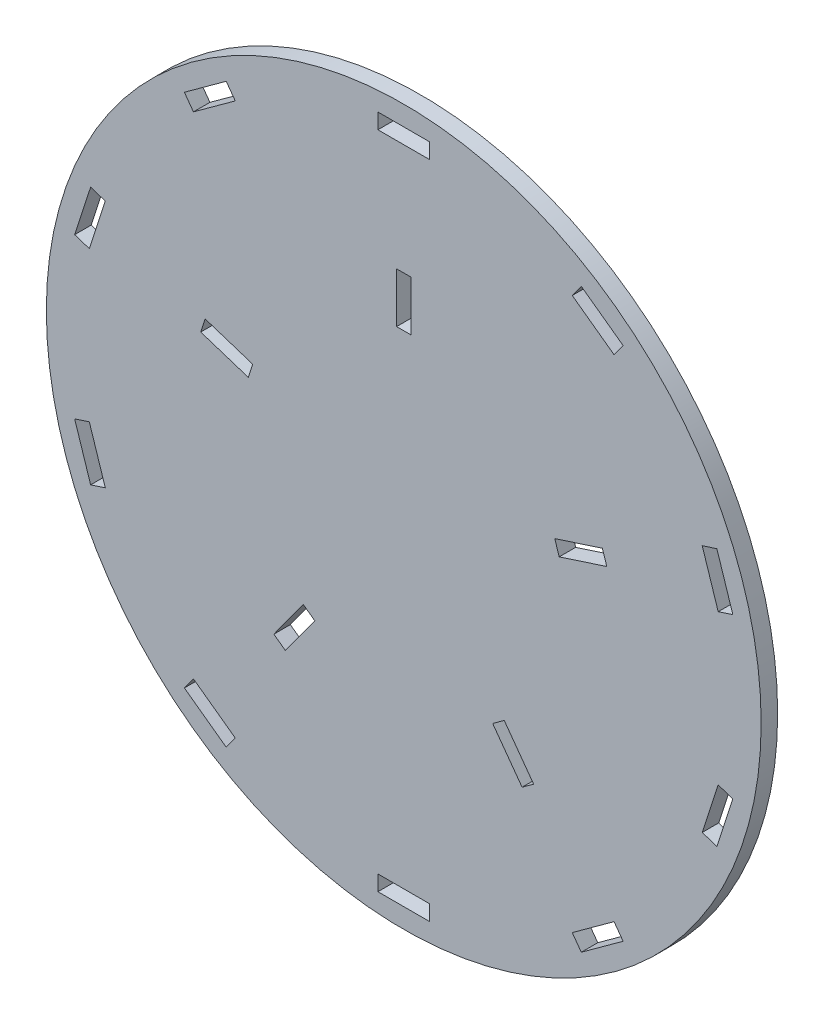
ISO-10303-21;
HEADER;
FILE_DESCRIPTION(('STEP AP214'),'2;1');
FILE_NAME('part.step','',(''),(''),'','','');
FILE_SCHEMA(('AUTOMOTIVE_DESIGN { 1 0 10303 214 1 1 1 1 }'));
ENDSEC;
DATA;
#1=APPLICATION_CONTEXT('core data for automotive mechanical design processes');
#2=APPLICATION_PROTOCOL_DEFINITION('international standard','automotive_design',2000,#1);
#3=PRODUCT_CONTEXT('',#1,'mechanical');
#4=PRODUCT('Part','Part','',(#3));
#5=PRODUCT_RELATED_PRODUCT_CATEGORY('part','',(#4));
#6=PRODUCT_DEFINITION_FORMATION('','',#4);
#7=PRODUCT_DEFINITION_CONTEXT('part definition',#1,'design');
#8=PRODUCT_DEFINITION('design','',#6,#7);
#9=PRODUCT_DEFINITION_SHAPE('','',#8);
#10=(LENGTH_UNIT() NAMED_UNIT(*) SI_UNIT(.MILLI.,.METRE.));
#11=(NAMED_UNIT(*) PLANE_ANGLE_UNIT() SI_UNIT($,.RADIAN.));
#12=(NAMED_UNIT(*) SI_UNIT($,.STERADIAN.) SOLID_ANGLE_UNIT());
#13=UNCERTAINTY_MEASURE_WITH_UNIT(LENGTH_MEASURE(1.E-05),#10,'distance_accuracy_value','');
#14=(GEOMETRIC_REPRESENTATION_CONTEXT(3) GLOBAL_UNCERTAINTY_ASSIGNED_CONTEXT((#13)) GLOBAL_UNIT_ASSIGNED_CONTEXT((#10,
#11,#12)) REPRESENTATION_CONTEXT('',''));
#15=CARTESIAN_POINT('',(0.,0.,0.));
#16=DIRECTION('',(0.,0.,1.));
#17=DIRECTION('',(1.,0.,0.));
#18=AXIS2_PLACEMENT_3D('',#15,#16,#17);
#19=CARTESIAN_POINT('',(0.,0.,3.));
#20=DIRECTION('',(0.,0.,1.));
#21=DIRECTION('',(1.,0.,0.));
#22=AXIS2_PLACEMENT_3D('',#19,#20,#21);
#23=PLANE('',#22);
#24=CARTESIAN_POINT('',(0.,0.,3.));
#25=DIRECTION('',(0.,0.,1.));
#26=DIRECTION('',(1.,0.,0.));
#27=AXIS2_PLACEMENT_3D('',#24,#25,#26);
#28=CIRCLE('',#27,65.);
#29=CARTESIAN_POINT('',(65.,0.,3.));
#30=VERTEX_POINT('',#29);
#31=EDGE_CURVE('E11',#30,#30,#28,.T.);
#32=ORIENTED_EDGE('',*,*,#31,.T.);
#33=EDGE_LOOP('',(#32));
#34=FACE_BOUND('',#33,.T.);
#35=DIRECTION('',(0.809016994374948,-0.587785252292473,0.));
#36=VECTOR('',#35,1.);
#37=CARTESIAN_POINT('',(30.6418359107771,50.170986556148,3.));
#38=LINE('',#37,#36);
#39=CARTESIAN_POINT('',(30.6418359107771,50.170986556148,3.));
#40=VERTEX_POINT('',#39);
#41=CARTESIAN_POINT('',(38.2465956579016,44.6458051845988,3.));
#42=VERTEX_POINT('',#41);
#43=EDGE_CURVE('E1033',#40,#42,#38,.T.);
#44=ORIENTED_EDGE('',*,*,#43,.F.);
#45=DIRECTION('',(-0.587785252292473,-0.809016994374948,0.));
#46=VECTOR('',#45,1.);
#47=CARTESIAN_POINT('',(30.6418359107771,50.170986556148,3.));
#48=LINE('',#47,#46);
#49=CARTESIAN_POINT('',(32.287634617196,52.4362341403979,3.));
#50=VERTEX_POINT('',#49);
#51=EDGE_CURVE('E1030',#50,#40,#48,.T.);
#52=ORIENTED_EDGE('',*,*,#51,.F.);
#53=DIRECTION('',(-0.809016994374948,0.587785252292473,0.));
#54=VECTOR('',#53,1.);
#55=CARTESIAN_POINT('',(32.287634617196,52.4362341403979,3.));
#56=LINE('',#55,#54);
#57=CARTESIAN_POINT('',(39.8923943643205,46.9110527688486,3.));
#58=VERTEX_POINT('',#57);
#59=EDGE_CURVE('E1041',#58,#50,#56,.T.);
#60=ORIENTED_EDGE('',*,*,#59,.F.);
#61=DIRECTION('',(0.587785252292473,0.809016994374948,0.));
#62=VECTOR('',#61,1.);
#63=CARTESIAN_POINT('',(38.2465956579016,44.6458051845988,3.));
#64=LINE('',#63,#62);
#65=EDGE_CURVE('E1037',#42,#58,#64,.T.);
#66=ORIENTED_EDGE('',*,*,#65,.F.);
#67=EDGE_LOOP('',(#44,#52,#60,#66));
#68=FACE_BOUND('',#67,.T.);
#69=DIRECTION('',(0.,1.,0.));
#70=VECTOR('',#69,1.);
#71=CARTESIAN_POINT('',(4.7,58.6,3.));
#72=LINE('',#71,#70);
#73=CARTESIAN_POINT('',(4.7,58.6,3.));
#74=VERTEX_POINT('',#73);
#75=CARTESIAN_POINT('',(4.7,61.4,3.));
#76=VERTEX_POINT('',#75);
#77=EDGE_CURVE('E990',#74,#76,#72,.T.);
#78=ORIENTED_EDGE('',*,*,#77,.F.);
#79=DIRECTION('',(1.,0.,0.));
#80=VECTOR('',#79,1.);
#81=CARTESIAN_POINT('',(-4.7,58.6,3.));
#82=LINE('',#81,#80);
#83=CARTESIAN_POINT('',(-4.7,58.6,3.));
#84=VERTEX_POINT('',#83);
#85=EDGE_CURVE('E987',#84,#74,#82,.T.);
#86=ORIENTED_EDGE('',*,*,#85,.F.);
#87=DIRECTION('',(0.,-1.,0.));
#88=VECTOR('',#87,1.);
#89=CARTESIAN_POINT('',(-4.7,58.6,3.));
#90=LINE('',#89,#88);
#91=CARTESIAN_POINT('',(-4.7,61.4,3.));
#92=VERTEX_POINT('',#91);
#93=EDGE_CURVE('E998',#92,#84,#90,.T.);
#94=ORIENTED_EDGE('',*,*,#93,.F.);
#95=DIRECTION('',(-1.,0.,0.));
#96=VECTOR('',#95,1.);
#97=CARTESIAN_POINT('',(-4.7,61.4,3.));
#98=LINE('',#97,#96);
#99=EDGE_CURVE('E994',#76,#92,#98,.T.);
#100=ORIENTED_EDGE('',*,*,#99,.F.);
#101=EDGE_LOOP('',(#78,#86,#94,#100));
#102=FACE_BOUND('',#101,.T.);
#103=DIRECTION('',(0.309016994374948,-0.951056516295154,0.));
#104=VECTOR('',#103,1.);
#105=CARTESIAN_POINT('',(54.2795319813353,22.5783614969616,3.));
#106=LINE('',#105,#104);
#107=CARTESIAN_POINT('',(54.2795319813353,22.5783614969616,3.));
#108=VERTEX_POINT('',#107);
#109=CARTESIAN_POINT('',(57.1842917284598,13.6384302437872,3.));
#110=VERTEX_POINT('',#109);
#111=EDGE_CURVE('E947',#108,#110,#106,.T.);
#112=ORIENTED_EDGE('',*,*,#111,.F.);
#113=DIRECTION('',(-0.951056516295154,-0.309016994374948,0.));
#114=VECTOR('',#113,1.);
#115=CARTESIAN_POINT('',(54.2795319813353,22.5783614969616,3.));
#116=LINE('',#115,#114);
#117=CARTESIAN_POINT('',(56.9424902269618,23.4436090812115,3.));
#118=VERTEX_POINT('',#117);
#119=EDGE_CURVE('E944',#118,#108,#116,.T.);
#120=ORIENTED_EDGE('',*,*,#119,.F.);
#121=DIRECTION('',(-0.309016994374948,0.951056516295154,0.));
#122=VECTOR('',#121,1.);
#123=CARTESIAN_POINT('',(56.9424902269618,23.4436090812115,3.));
#124=LINE('',#123,#122);
#125=CARTESIAN_POINT('',(59.8472499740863,14.503677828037,3.));
#126=VERTEX_POINT('',#125);
#127=EDGE_CURVE('E955',#126,#118,#124,.T.);
#128=ORIENTED_EDGE('',*,*,#127,.F.);
#129=DIRECTION('',(0.951056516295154,0.309016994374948,0.));
#130=VECTOR('',#129,1.);
#131=CARTESIAN_POINT('',(57.1842917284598,13.6384302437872,3.));
#132=LINE('',#131,#130);
#133=EDGE_CURVE('E951',#110,#126,#132,.T.);
#134=ORIENTED_EDGE('',*,*,#133,.F.);
#135=EDGE_LOOP('',(#112,#120,#128,#134));
#136=FACE_BOUND('',#135,.T.);
#137=DIRECTION('',(-0.309016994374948,-0.951056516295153,0.));
#138=VECTOR('',#137,1.);
#139=CARTESIAN_POINT('',(57.1842917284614,-13.6384302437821,3.));
#140=LINE('',#139,#138);
#141=CARTESIAN_POINT('',(57.1842917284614,-13.6384302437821,3.));
#142=VERTEX_POINT('',#141);
#143=CARTESIAN_POINT('',(54.2795319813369,-22.5783614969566,3.));
#144=VERTEX_POINT('',#143);
#145=EDGE_CURVE('E904',#142,#144,#140,.T.);
#146=ORIENTED_EDGE('',*,*,#145,.F.);
#147=DIRECTION('',(-0.951056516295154,0.309016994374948,0.));
#148=VECTOR('',#147,1.);
#149=CARTESIAN_POINT('',(57.1842917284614,-13.6384302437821,3.));
#150=LINE('',#149,#148);
#151=CARTESIAN_POINT('',(59.8472499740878,-14.503677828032,3.));
#152=VERTEX_POINT('',#151);
#153=EDGE_CURVE('E901',#152,#142,#150,.T.);
#154=ORIENTED_EDGE('',*,*,#153,.F.);
#155=DIRECTION('',(0.309016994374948,0.951056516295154,0.));
#156=VECTOR('',#155,1.);
#157=CARTESIAN_POINT('',(59.8472499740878,-14.503677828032,3.));
#158=LINE('',#157,#156);
#159=CARTESIAN_POINT('',(56.9424902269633,-23.4436090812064,3.));
#160=VERTEX_POINT('',#159);
#161=EDGE_CURVE('E912',#160,#152,#158,.T.);
#162=ORIENTED_EDGE('',*,*,#161,.F.);
#163=DIRECTION('',(0.951056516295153,-0.309016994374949,0.));
#164=VECTOR('',#163,1.);
#165=CARTESIAN_POINT('',(54.2795319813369,-22.5783614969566,3.));
#166=LINE('',#165,#164);
#167=EDGE_CURVE('E908',#144,#160,#166,.T.);
#168=ORIENTED_EDGE('',*,*,#167,.F.);
#169=EDGE_LOOP('',(#146,#154,#162,#168));
#170=FACE_BOUND('',#169,.T.);
#171=DIRECTION('',(-0.809016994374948,-0.587785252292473,0.));
#172=VECTOR('',#171,1.);
#173=CARTESIAN_POINT('',(38.2465956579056,-44.6458051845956,3.));
#174=LINE('',#173,#172);
#175=CARTESIAN_POINT('',(38.2465956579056,-44.6458051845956,3.));
#176=VERTEX_POINT('',#175);
#177=CARTESIAN_POINT('',(30.6418359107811,-50.1709865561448,3.));
#178=VERTEX_POINT('',#177);
#179=EDGE_CURVE('E861',#176,#178,#174,.T.);
#180=ORIENTED_EDGE('',*,*,#179,.F.);
#181=DIRECTION('',(-0.587785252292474,0.809016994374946,0.));
#182=VECTOR('',#181,1.);
#183=CARTESIAN_POINT('',(38.2465956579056,-44.6458051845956,3.));
#184=LINE('',#183,#182);
#185=CARTESIAN_POINT('',(39.8923943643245,-46.9110527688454,3.));
#186=VERTEX_POINT('',#185);
#187=EDGE_CURVE('E858',#186,#176,#184,.T.);
#188=ORIENTED_EDGE('',*,*,#187,.F.);
#189=DIRECTION('',(0.809016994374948,0.587785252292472,0.));
#190=VECTOR('',#189,1.);
#191=CARTESIAN_POINT('',(39.8923943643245,-46.9110527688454,3.));
#192=LINE('',#191,#190);
#193=CARTESIAN_POINT('',(32.2876346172,-52.4362341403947,3.));
#194=VERTEX_POINT('',#193);
#195=EDGE_CURVE('E869',#194,#186,#192,.T.);
#196=ORIENTED_EDGE('',*,*,#195,.F.);
#197=DIRECTION('',(0.587785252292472,-0.809016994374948,0.));
#198=VECTOR('',#197,1.);
#199=CARTESIAN_POINT('',(30.6418359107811,-50.1709865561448,3.));
#200=LINE('',#199,#198);
#201=EDGE_CURVE('E865',#178,#194,#200,.T.);
#202=ORIENTED_EDGE('',*,*,#201,.F.);
#203=EDGE_LOOP('',(#180,#188,#196,#202));
#204=FACE_BOUND('',#203,.T.);
#205=DIRECTION('',(-1.,0.,0.));
#206=VECTOR('',#205,1.);
#207=CARTESIAN_POINT('',(4.70000000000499,-58.5999999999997,3.));
#208=LINE('',#207,#206);
#209=CARTESIAN_POINT('',(4.70000000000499,-58.5999999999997,3.));
#210=VERTEX_POINT('',#209);
#211=CARTESIAN_POINT('',(-4.69999999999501,-58.5999999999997,3.));
#212=VERTEX_POINT('',#211);
#213=EDGE_CURVE('E818',#210,#212,#208,.T.);
#214=ORIENTED_EDGE('',*,*,#213,.F.);
#215=DIRECTION('',(0.,1.,0.));
#216=VECTOR('',#215,1.);
#217=CARTESIAN_POINT('',(4.70000000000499,-58.5999999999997,3.));
#218=LINE('',#217,#216);
#219=CARTESIAN_POINT('',(4.70000000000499,-61.3999999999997,3.));
#220=VERTEX_POINT('',#219);
#221=EDGE_CURVE('E815',#220,#210,#218,.T.);
#222=ORIENTED_EDGE('',*,*,#221,.F.);
#223=DIRECTION('',(1.,0.,0.));
#224=VECTOR('',#223,1.);
#225=CARTESIAN_POINT('',(4.70000000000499,-61.3999999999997,3.));
#226=LINE('',#225,#224);
#227=CARTESIAN_POINT('',(-4.69999999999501,-61.3999999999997,3.));
#228=VERTEX_POINT('',#227);
#229=EDGE_CURVE('E826',#228,#220,#226,.T.);
#230=ORIENTED_EDGE('',*,*,#229,.F.);
#231=DIRECTION('',(0.,-1.,0.));
#232=VECTOR('',#231,1.);
#233=CARTESIAN_POINT('',(-4.69999999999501,-58.5999999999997,3.));
#234=LINE('',#233,#232);
#235=EDGE_CURVE('E822',#212,#228,#234,.T.);
#236=ORIENTED_EDGE('',*,*,#235,.F.);
#237=EDGE_LOOP('',(#214,#222,#230,#236));
#238=FACE_BOUND('',#237,.T.);
#239=DIRECTION('',(-0.809016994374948,0.587785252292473,0.));
#240=VECTOR('',#239,1.);
#241=CARTESIAN_POINT('',(-30.6418359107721,-50.1709865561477,3.));
#242=LINE('',#241,#240);
#243=CARTESIAN_POINT('',(-30.6418359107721,-50.1709865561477,3.));
#244=VERTEX_POINT('',#243);
#245=CARTESIAN_POINT('',(-38.2465956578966,-44.6458051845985,3.));
#246=VERTEX_POINT('',#245);
#247=EDGE_CURVE('E775',#244,#246,#242,.T.);
#248=ORIENTED_EDGE('',*,*,#247,.F.);
#249=DIRECTION('',(0.587785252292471,0.809016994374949,0.));
#250=VECTOR('',#249,1.);
#251=CARTESIAN_POINT('',(-30.6418359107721,-50.1709865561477,3.));
#252=LINE('',#251,#250);
#253=CARTESIAN_POINT('',(-32.287634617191,-52.4362341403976,3.));
#254=VERTEX_POINT('',#253);
#255=EDGE_CURVE('E772',#254,#244,#252,.T.);
#256=ORIENTED_EDGE('',*,*,#255,.F.);
#257=DIRECTION('',(0.809016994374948,-0.587785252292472,0.));
#258=VECTOR('',#257,1.);
#259=CARTESIAN_POINT('',(-32.287634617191,-52.4362341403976,3.));
#260=LINE('',#259,#258);
#261=CARTESIAN_POINT('',(-39.8923943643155,-46.9110527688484,3.));
#262=VERTEX_POINT('',#261);
#263=EDGE_CURVE('E783',#262,#254,#260,.T.);
#264=ORIENTED_EDGE('',*,*,#263,.F.);
#265=DIRECTION('',(-0.587785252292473,-0.809016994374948,0.));
#266=VECTOR('',#265,1.);
#267=CARTESIAN_POINT('',(-38.2465956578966,-44.6458051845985,3.));
#268=LINE('',#267,#266);
#269=EDGE_CURVE('E779',#246,#262,#268,.T.);
#270=ORIENTED_EDGE('',*,*,#269,.F.);
#271=EDGE_LOOP('',(#248,#256,#264,#270));
#272=FACE_BOUND('',#271,.T.);
#273=DIRECTION('',(-0.309016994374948,0.951056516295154,0.));
#274=VECTOR('',#273,1.);
#275=CARTESIAN_POINT('',(-54.2795319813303,-22.5783614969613,3.));
#276=LINE('',#275,#274);
#277=CARTESIAN_POINT('',(-54.2795319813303,-22.5783614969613,3.));
#278=VERTEX_POINT('',#277);
#279=CARTESIAN_POINT('',(-57.1842917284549,-13.6384302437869,3.));
#280=VERTEX_POINT('',#279);
#281=EDGE_CURVE('E732',#278,#280,#276,.T.);
#282=ORIENTED_EDGE('',*,*,#281,.F.);
#283=DIRECTION('',(0.951056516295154,0.309016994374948,0.));
#284=VECTOR('',#283,1.);
#285=CARTESIAN_POINT('',(-54.2795319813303,-22.5783614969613,3.));
#286=LINE('',#285,#284);
#287=CARTESIAN_POINT('',(-56.9424902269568,-23.4436090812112,3.));
#288=VERTEX_POINT('',#287);
#289=EDGE_CURVE('E729',#288,#278,#286,.T.);
#290=ORIENTED_EDGE('',*,*,#289,.F.);
#291=DIRECTION('',(0.309016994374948,-0.951056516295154,0.));
#292=VECTOR('',#291,1.);
#293=CARTESIAN_POINT('',(-56.9424902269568,-23.4436090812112,3.));
#294=LINE('',#293,#292);
#295=CARTESIAN_POINT('',(-59.8472499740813,-14.5036778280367,3.));
#296=VERTEX_POINT('',#295);
#297=EDGE_CURVE('E740',#296,#288,#294,.T.);
#298=ORIENTED_EDGE('',*,*,#297,.F.);
#299=DIRECTION('',(-0.951056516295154,-0.309016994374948,0.));
#300=VECTOR('',#299,1.);
#301=CARTESIAN_POINT('',(-57.1842917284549,-13.6384302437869,3.));
#302=LINE('',#301,#300);
#303=EDGE_CURVE('E736',#280,#296,#302,.T.);
#304=ORIENTED_EDGE('',*,*,#303,.F.);
#305=EDGE_LOOP('',(#282,#290,#298,#304));
#306=FACE_BOUND('',#305,.T.);
#307=DIRECTION('',(0.309016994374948,0.951056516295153,0.));
#308=VECTOR('',#307,1.);
#309=CARTESIAN_POINT('',(-57.1842917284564,13.6384302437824,3.));
#310=LINE('',#309,#308);
#311=CARTESIAN_POINT('',(-57.1842917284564,13.6384302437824,3.));
#312=VERTEX_POINT('',#311);
#313=CARTESIAN_POINT('',(-54.2795319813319,22.5783614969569,3.));
#314=VERTEX_POINT('',#313);
#315=EDGE_CURVE('E689',#312,#314,#310,.T.);
#316=ORIENTED_EDGE('',*,*,#315,.F.);
#317=DIRECTION('',(0.951056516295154,-0.309016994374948,0.));
#318=VECTOR('',#317,1.);
#319=CARTESIAN_POINT('',(-57.1842917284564,13.6384302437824,3.));
#320=LINE('',#319,#318);
#321=CARTESIAN_POINT('',(-59.8472499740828,14.5036778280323,3.));
#322=VERTEX_POINT('',#321);
#323=EDGE_CURVE('E686',#322,#312,#320,.T.);
#324=ORIENTED_EDGE('',*,*,#323,.F.);
#325=DIRECTION('',(-0.309016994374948,-0.951056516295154,0.));
#326=VECTOR('',#325,1.);
#327=CARTESIAN_POINT('',(-59.8472499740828,14.5036778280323,3.));
#328=LINE('',#327,#326);
#329=CARTESIAN_POINT('',(-56.9424902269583,23.4436090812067,3.));
#330=VERTEX_POINT('',#329);
#331=EDGE_CURVE('E697',#330,#322,#328,.T.);
#332=ORIENTED_EDGE('',*,*,#331,.F.);
#333=DIRECTION('',(-0.951056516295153,0.309016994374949,0.));
#334=VECTOR('',#333,1.);
#335=CARTESIAN_POINT('',(-54.2795319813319,22.5783614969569,3.));
#336=LINE('',#335,#334);
#337=EDGE_CURVE('E693',#314,#330,#336,.T.);
#338=ORIENTED_EDGE('',*,*,#337,.F.);
#339=EDGE_LOOP('',(#316,#324,#332,#338));
#340=FACE_BOUND('',#339,.T.);
#341=DIRECTION('',(0.809016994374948,0.587785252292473,0.));
#342=VECTOR('',#341,1.);
#343=CARTESIAN_POINT('',(-38.2465956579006,44.6458051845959,3.));
#344=LINE('',#343,#342);
#345=CARTESIAN_POINT('',(-38.2465956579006,44.6458051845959,3.));
#346=VERTEX_POINT('',#345);
#347=CARTESIAN_POINT('',(-30.6418359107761,50.1709865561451,3.));
#348=VERTEX_POINT('',#347);
#349=EDGE_CURVE('E646',#346,#348,#344,.T.);
#350=ORIENTED_EDGE('',*,*,#349,.F.);
#351=DIRECTION('',(0.587785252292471,-0.809016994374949,0.));
#352=VECTOR('',#351,1.);
#353=CARTESIAN_POINT('',(-38.2465956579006,44.6458051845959,3.));
#354=LINE('',#353,#352);
#355=CARTESIAN_POINT('',(-39.8923943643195,46.9110527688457,3.));
#356=VERTEX_POINT('',#355);
#357=EDGE_CURVE('E643',#356,#346,#354,.T.);
#358=ORIENTED_EDGE('',*,*,#357,.F.);
#359=DIRECTION('',(-0.809016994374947,-0.587785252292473,0.));
#360=VECTOR('',#359,1.);
#361=CARTESIAN_POINT('',(-39.8923943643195,46.9110527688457,3.));
#362=LINE('',#361,#360);
#363=CARTESIAN_POINT('',(-32.287634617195,52.436234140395,3.));
#364=VERTEX_POINT('',#363);
#365=EDGE_CURVE('E654',#364,#356,#362,.T.);
#366=ORIENTED_EDGE('',*,*,#365,.F.);
#367=DIRECTION('',(-0.587785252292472,0.809016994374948,0.));
#368=VECTOR('',#367,1.);
#369=CARTESIAN_POINT('',(-30.6418359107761,50.1709865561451,3.));
#370=LINE('',#369,#368);
#371=EDGE_CURVE('E650',#348,#364,#370,.T.);
#372=ORIENTED_EDGE('',*,*,#371,.F.);
#373=EDGE_LOOP('',(#350,#358,#366,#372));
#374=FACE_BOUND('',#373,.T.);
#375=DIRECTION('',(1.,0.,0.));
#376=VECTOR('',#375,1.);
#377=CARTESIAN_POINT('',(-1.30000000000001,29.3,3.));
#378=LINE('',#377,#376);
#379=CARTESIAN_POINT('',(-1.30000000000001,29.3,3.));
#380=VERTEX_POINT('',#379);
#381=CARTESIAN_POINT('',(1.29999999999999,29.3,3.));
#382=VERTEX_POINT('',#381);
#383=EDGE_CURVE('E603',#380,#382,#378,.T.);
#384=ORIENTED_EDGE('',*,*,#383,.F.);
#385=DIRECTION('',(0.,-1.,0.));
#386=VECTOR('',#385,1.);
#387=CARTESIAN_POINT('',(-1.30000000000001,29.3,3.));
#388=LINE('',#387,#386);
#389=CARTESIAN_POINT('',(-1.30000000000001,38.4,3.));
#390=VERTEX_POINT('',#389);
#391=EDGE_CURVE('E600',#390,#380,#388,.T.);
#392=ORIENTED_EDGE('',*,*,#391,.F.);
#393=DIRECTION('',(-1.,0.,0.));
#394=VECTOR('',#393,1.);
#395=CARTESIAN_POINT('',(-1.30000000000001,38.4,3.));
#396=LINE('',#395,#394);
#397=CARTESIAN_POINT('',(1.29999999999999,38.4,3.));
#398=VERTEX_POINT('',#397);
#399=EDGE_CURVE('E611',#398,#390,#396,.T.);
#400=ORIENTED_EDGE('',*,*,#399,.F.);
#401=DIRECTION('',(0.,1.,0.));
#402=VECTOR('',#401,1.);
#403=CARTESIAN_POINT('',(1.29999999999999,29.3,3.));
#404=LINE('',#403,#402);
#405=EDGE_CURVE('E607',#382,#398,#404,.T.);
#406=ORIENTED_EDGE('',*,*,#405,.F.);
#407=EDGE_LOOP('',(#384,#392,#400,#406));
#408=FACE_BOUND('',#407,.T.);
#409=DIRECTION('',(0.309016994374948,-0.951056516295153,0.));
#410=VECTOR('',#409,1.);
#411=CARTESIAN_POINT('',(27.4642338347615,10.2905714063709,3.));
#412=LINE('',#411,#410);
#413=CARTESIAN_POINT('',(27.4642338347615,10.2905714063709,3.));
#414=VERTEX_POINT('',#413);
#415=CARTESIAN_POINT('',(28.2676780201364,7.81782446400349,3.));
#416=VERTEX_POINT('',#415);
#417=EDGE_CURVE('E560',#414,#416,#412,.T.);
#418=ORIENTED_EDGE('',*,*,#417,.F.);
#419=DIRECTION('',(-0.951056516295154,-0.309016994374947,0.));
#420=VECTOR('',#419,1.);
#421=CARTESIAN_POINT('',(27.4642338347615,10.2905714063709,3.));
#422=LINE('',#421,#420);
#423=CARTESIAN_POINT('',(36.1188481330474,13.1026260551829,3.));
#424=VERTEX_POINT('',#423);
#425=EDGE_CURVE('E557',#424,#414,#422,.T.);
#426=ORIENTED_EDGE('',*,*,#425,.F.);
#427=DIRECTION('',(-0.309016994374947,0.951056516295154,0.));
#428=VECTOR('',#427,1.);
#429=CARTESIAN_POINT('',(36.1188481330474,13.1026260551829,3.));
#430=LINE('',#429,#428);
#431=CARTESIAN_POINT('',(36.9222923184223,10.6298791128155,3.));
#432=VERTEX_POINT('',#431);
#433=EDGE_CURVE('E568',#432,#424,#430,.T.);
#434=ORIENTED_EDGE('',*,*,#433,.F.);
#435=DIRECTION('',(0.951056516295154,0.309016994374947,0.));
#436=VECTOR('',#435,1.);
#437=CARTESIAN_POINT('',(28.2676780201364,7.81782446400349,3.));
#438=LINE('',#437,#436);
#439=EDGE_CURVE('E564',#416,#432,#438,.T.);
#440=ORIENTED_EDGE('',*,*,#439,.F.);
#441=EDGE_LOOP('',(#418,#426,#434,#440));
#442=FACE_BOUND('',#441,.T.);
#443=DIRECTION('',(-0.809016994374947,-0.587785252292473,0.));
#444=VECTOR('',#443,1.);
#445=CARTESIAN_POINT('',(18.2738299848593,-22.9400771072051,3.));
#446=LINE('',#445,#444);
#447=CARTESIAN_POINT('',(18.2738299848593,-22.9400771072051,3.));
#448=VERTEX_POINT('',#447);
#449=CARTESIAN_POINT('',(16.1703857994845,-24.4683187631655,3.));
#450=VERTEX_POINT('',#449);
#451=EDGE_CURVE('E517',#448,#450,#446,.T.);
#452=ORIENTED_EDGE('',*,*,#451,.F.);
#453=DIRECTION('',(-0.587785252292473,0.809016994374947,0.));
#454=VECTOR('',#453,1.);
#455=CARTESIAN_POINT('',(18.2738299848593,-22.9400771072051,3.));
#456=LINE('',#455,#454);
#457=CARTESIAN_POINT('',(23.6226757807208,-30.3021317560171,3.));
#458=VERTEX_POINT('',#457);
#459=EDGE_CURVE('E514',#458,#448,#456,.T.);
#460=ORIENTED_EDGE('',*,*,#459,.F.);
#461=DIRECTION('',(0.809016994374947,0.587785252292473,0.));
#462=VECTOR('',#461,1.);
#463=CARTESIAN_POINT('',(23.6226757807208,-30.3021317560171,3.));
#464=LINE('',#463,#462);
#465=CARTESIAN_POINT('',(21.519231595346,-31.8303734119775,3.));
#466=VERTEX_POINT('',#465);
#467=EDGE_CURVE('E525',#466,#458,#464,.T.);
#468=ORIENTED_EDGE('',*,*,#467,.F.);
#469=DIRECTION('',(0.587785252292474,-0.809016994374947,0.));
#470=VECTOR('',#469,1.);
#471=CARTESIAN_POINT('',(16.1703857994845,-24.4683187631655,3.));
#472=LINE('',#471,#470);
#473=EDGE_CURVE('E521',#450,#466,#472,.T.);
#474=ORIENTED_EDGE('',*,*,#473,.F.);
#475=EDGE_LOOP('',(#452,#460,#468,#474));
#476=FACE_BOUND('',#475,.T.);
#477=DIRECTION('',(-0.809016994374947,0.587785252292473,0.));
#478=VECTOR('',#477,1.);
#479=CARTESIAN_POINT('',(-16.1703857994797,-24.4683187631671,3.));
#480=LINE('',#479,#478);
#481=CARTESIAN_POINT('',(-16.1703857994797,-24.4683187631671,3.));
#482=VERTEX_POINT('',#481);
#483=CARTESIAN_POINT('',(-18.2738299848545,-22.9400771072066,3.));
#484=VERTEX_POINT('',#483);
#485=EDGE_CURVE('E474',#482,#484,#480,.T.);
#486=ORIENTED_EDGE('',*,*,#485,.F.);
#487=DIRECTION('',(0.587785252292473,0.809016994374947,0.));
#488=VECTOR('',#487,1.);
#489=CARTESIAN_POINT('',(-16.1703857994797,-24.4683187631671,3.));
#490=LINE('',#489,#488);
#491=CARTESIAN_POINT('',(-21.5192315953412,-31.8303734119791,3.));
#492=VERTEX_POINT('',#491);
#493=EDGE_CURVE('E471',#492,#482,#490,.T.);
#494=ORIENTED_EDGE('',*,*,#493,.F.);
#495=DIRECTION('',(0.809016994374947,-0.587785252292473,0.));
#496=VECTOR('',#495,1.);
#497=CARTESIAN_POINT('',(-21.5192315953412,-31.8303734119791,3.));
#498=LINE('',#497,#496);
#499=CARTESIAN_POINT('',(-23.622675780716,-30.3021317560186,3.));
#500=VERTEX_POINT('',#499);
#501=EDGE_CURVE('E482',#500,#492,#498,.T.);
#502=ORIENTED_EDGE('',*,*,#501,.F.);
#503=DIRECTION('',(-0.587785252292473,-0.809016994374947,0.));
#504=VECTOR('',#503,1.);
#505=CARTESIAN_POINT('',(-18.2738299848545,-22.9400771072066,3.));
#506=LINE('',#505,#504);
#507=EDGE_CURVE('E478',#484,#500,#506,.T.);
#508=ORIENTED_EDGE('',*,*,#507,.F.);
#509=EDGE_LOOP('',(#486,#494,#502,#508));
#510=FACE_BOUND('',#509,.T.);
#511=DIRECTION('',(0.309016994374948,0.951056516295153,0.));
#512=VECTOR('',#511,1.);
#513=CARTESIAN_POINT('',(-28.2676780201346,7.81782446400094,3.));
#514=LINE('',#513,#512);
#515=CARTESIAN_POINT('',(-28.2676780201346,7.81782446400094,3.));
#516=VERTEX_POINT('',#515);
#517=CARTESIAN_POINT('',(-27.4642338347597,10.2905714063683,3.));
#518=VERTEX_POINT('',#517);
#519=EDGE_CURVE('E432',#516,#518,#514,.T.);
#520=ORIENTED_EDGE('',*,*,#519,.F.);
#521=DIRECTION('',(0.951056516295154,-0.309016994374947,0.));
#522=VECTOR('',#521,1.);
#523=CARTESIAN_POINT('',(-28.2676780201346,7.81782446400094,3.));
#524=LINE('',#523,#522);
#525=CARTESIAN_POINT('',(-36.9222923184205,10.629879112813,3.));
#526=VERTEX_POINT('',#525);
#527=EDGE_CURVE('E423',#526,#516,#524,.T.);
#528=ORIENTED_EDGE('',*,*,#527,.F.);
#529=DIRECTION('',(-0.309016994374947,-0.951056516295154,0.));
#530=VECTOR('',#529,1.);
#531=CARTESIAN_POINT('',(-36.9222923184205,10.629879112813,3.));
#532=LINE('',#531,#530);
#533=CARTESIAN_POINT('',(-36.1188481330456,13.1026260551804,3.));
#534=VERTEX_POINT('',#533);
#535=EDGE_CURVE('E449',#534,#526,#532,.T.);
#536=ORIENTED_EDGE('',*,*,#535,.F.);
#537=DIRECTION('',(-0.951056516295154,0.309016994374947,0.));
#538=VECTOR('',#537,1.);
#539=CARTESIAN_POINT('',(-27.4642338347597,10.2905714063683,3.));
#540=LINE('',#539,#538);
#541=EDGE_CURVE('E445',#518,#534,#540,.T.);
#542=ORIENTED_EDGE('',*,*,#541,.F.);
#543=EDGE_LOOP('',(#520,#528,#536,#542));
#544=FACE_BOUND('',#543,.T.);
#545=ADVANCED_FACE('F45',(#34,#68,#102,#136,#170,#204,#238,#272,#306,#340,#374,#408,#442,#476,
#510,#544),#23,.T.);
#546=CARTESIAN_POINT('',(0.,0.,0.));
#547=DIRECTION('',(0.,0.,1.));
#548=DIRECTION('',(1.,0.,0.));
#549=AXIS2_PLACEMENT_3D('',#546,#547,#548);
#550=PLANE('',#549);
#551=DIRECTION('',(0.587785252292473,0.809016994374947,0.));
#552=VECTOR('',#551,1.);
#553=CARTESIAN_POINT('',(-16.1703857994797,-24.4683187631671,0.));
#554=LINE('',#553,#552);
#555=CARTESIAN_POINT('',(-21.5192315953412,-31.8303734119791,0.));
#556=VERTEX_POINT('',#555);
#557=CARTESIAN_POINT('',(-16.1703857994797,-24.4683187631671,0.));
#558=VERTEX_POINT('',#557);
#559=EDGE_CURVE('E441',#556,#558,#554,.T.);
#560=ORIENTED_EDGE('',*,*,#559,.T.);
#561=DIRECTION('',(-0.809016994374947,0.587785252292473,0.));
#562=VECTOR('',#561,1.);
#563=CARTESIAN_POINT('',(-16.1703857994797,-24.4683187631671,0.));
#564=LINE('',#563,#562);
#565=CARTESIAN_POINT('',(-18.2738299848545,-22.9400771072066,0.));
#566=VERTEX_POINT('',#565);
#567=EDGE_CURVE('E489',#558,#566,#564,.T.);
#568=ORIENTED_EDGE('',*,*,#567,.T.);
#569=DIRECTION('',(-0.587785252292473,-0.809016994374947,0.));
#570=VECTOR('',#569,1.);
#571=CARTESIAN_POINT('',(-18.2738299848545,-22.9400771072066,0.));
#572=LINE('',#571,#570);
#573=CARTESIAN_POINT('',(-23.622675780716,-30.3021317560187,0.));
#574=VERTEX_POINT('',#573);
#575=EDGE_CURVE('E493',#566,#574,#572,.T.);
#576=ORIENTED_EDGE('',*,*,#575,.T.);
#577=DIRECTION('',(0.809016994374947,-0.587785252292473,0.));
#578=VECTOR('',#577,1.);
#579=CARTESIAN_POINT('',(-21.5192315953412,-31.8303734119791,0.));
#580=LINE('',#579,#578);
#581=EDGE_CURVE('E475',#574,#556,#580,.T.);
#582=ORIENTED_EDGE('',*,*,#581,.T.);
#583=EDGE_LOOP('',(#560,#568,#576,#582));
#584=FACE_BOUND('',#583,.T.);
#585=DIRECTION('',(-0.951056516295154,-0.309016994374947,0.));
#586=VECTOR('',#585,1.);
#587=CARTESIAN_POINT('',(27.4642338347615,10.2905714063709,0.));
#588=LINE('',#587,#586);
#589=CARTESIAN_POINT('',(36.1188481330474,13.1026260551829,0.));
#590=VERTEX_POINT('',#589);
#591=CARTESIAN_POINT('',(27.4642338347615,10.2905714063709,0.));
#592=VERTEX_POINT('',#591);
#593=EDGE_CURVE('E556',#590,#592,#588,.T.);
#594=ORIENTED_EDGE('',*,*,#593,.T.);
#595=DIRECTION('',(0.309016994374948,-0.951056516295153,0.));
#596=VECTOR('',#595,1.);
#597=CARTESIAN_POINT('',(27.4642338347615,10.2905714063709,0.));
#598=LINE('',#597,#596);
#599=CARTESIAN_POINT('',(28.2676780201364,7.81782446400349,0.));
#600=VERTEX_POINT('',#599);
#601=EDGE_CURVE('E575',#592,#600,#598,.T.);
#602=ORIENTED_EDGE('',*,*,#601,.T.);
#603=DIRECTION('',(0.951056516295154,0.309016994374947,0.));
#604=VECTOR('',#603,1.);
#605=CARTESIAN_POINT('',(28.2676780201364,7.81782446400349,0.));
#606=LINE('',#605,#604);
#607=CARTESIAN_POINT('',(36.9222923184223,10.6298791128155,0.));
#608=VERTEX_POINT('',#607);
#609=EDGE_CURVE('E579',#600,#608,#606,.T.);
#610=ORIENTED_EDGE('',*,*,#609,.T.);
#611=DIRECTION('',(-0.309016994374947,0.951056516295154,0.));
#612=VECTOR('',#611,1.);
#613=CARTESIAN_POINT('',(36.1188481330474,13.1026260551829,0.));
#614=LINE('',#613,#612);
#615=EDGE_CURVE('E561',#608,#590,#614,.T.);
#616=ORIENTED_EDGE('',*,*,#615,.T.);
#617=EDGE_LOOP('',(#594,#602,#610,#616));
#618=FACE_BOUND('',#617,.T.);
#619=DIRECTION('',(0.587785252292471,-0.809016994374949,0.));
#620=VECTOR('',#619,1.);
#621=CARTESIAN_POINT('',(-38.2465956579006,44.6458051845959,0.));
#622=LINE('',#621,#620);
#623=CARTESIAN_POINT('',(-39.8923943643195,46.9110527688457,0.));
#624=VERTEX_POINT('',#623);
#625=CARTESIAN_POINT('',(-38.2465956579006,44.6458051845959,0.));
#626=VERTEX_POINT('',#625);
#627=EDGE_CURVE('E642',#624,#626,#622,.T.);
#628=ORIENTED_EDGE('',*,*,#627,.T.);
#629=DIRECTION('',(0.809016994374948,0.587785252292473,0.));
#630=VECTOR('',#629,1.);
#631=CARTESIAN_POINT('',(-38.2465956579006,44.6458051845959,0.));
#632=LINE('',#631,#630);
#633=CARTESIAN_POINT('',(-30.6418359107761,50.1709865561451,0.));
#634=VERTEX_POINT('',#633);
#635=EDGE_CURVE('E661',#626,#634,#632,.T.);
#636=ORIENTED_EDGE('',*,*,#635,.T.);
#637=DIRECTION('',(-0.587785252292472,0.809016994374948,0.));
#638=VECTOR('',#637,1.);
#639=CARTESIAN_POINT('',(-30.6418359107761,50.1709865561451,0.));
#640=LINE('',#639,#638);
#641=CARTESIAN_POINT('',(-32.287634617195,52.436234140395,0.));
#642=VERTEX_POINT('',#641);
#643=EDGE_CURVE('E665',#634,#642,#640,.T.);
#644=ORIENTED_EDGE('',*,*,#643,.T.);
#645=DIRECTION('',(-0.809016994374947,-0.587785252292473,0.));
#646=VECTOR('',#645,1.);
#647=CARTESIAN_POINT('',(-39.8923943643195,46.9110527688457,0.));
#648=LINE('',#647,#646);
#649=EDGE_CURVE('E647',#642,#624,#648,.T.);
#650=ORIENTED_EDGE('',*,*,#649,.T.);
#651=EDGE_LOOP('',(#628,#636,#644,#650));
#652=FACE_BOUND('',#651,.T.);
#653=DIRECTION('',(0.951056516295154,0.309016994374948,0.));
#654=VECTOR('',#653,1.);
#655=CARTESIAN_POINT('',(-54.2795319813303,-22.5783614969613,0.));
#656=LINE('',#655,#654);
#657=CARTESIAN_POINT('',(-56.9424902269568,-23.4436090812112,0.));
#658=VERTEX_POINT('',#657);
#659=CARTESIAN_POINT('',(-54.2795319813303,-22.5783614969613,0.));
#660=VERTEX_POINT('',#659);
#661=EDGE_CURVE('E728',#658,#660,#656,.T.);
#662=ORIENTED_EDGE('',*,*,#661,.T.);
#663=DIRECTION('',(-0.309016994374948,0.951056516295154,0.));
#664=VECTOR('',#663,1.);
#665=CARTESIAN_POINT('',(-54.2795319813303,-22.5783614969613,0.));
#666=LINE('',#665,#664);
#667=CARTESIAN_POINT('',(-57.1842917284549,-13.6384302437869,0.));
#668=VERTEX_POINT('',#667);
#669=EDGE_CURVE('E747',#660,#668,#666,.T.);
#670=ORIENTED_EDGE('',*,*,#669,.T.);
#671=DIRECTION('',(-0.951056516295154,-0.309016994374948,0.));
#672=VECTOR('',#671,1.);
#673=CARTESIAN_POINT('',(-57.1842917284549,-13.6384302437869,0.));
#674=LINE('',#673,#672);
#675=CARTESIAN_POINT('',(-59.8472499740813,-14.5036778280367,0.));
#676=VERTEX_POINT('',#675);
#677=EDGE_CURVE('E751',#668,#676,#674,.T.);
#678=ORIENTED_EDGE('',*,*,#677,.T.);
#679=DIRECTION('',(0.309016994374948,-0.951056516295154,0.));
#680=VECTOR('',#679,1.);
#681=CARTESIAN_POINT('',(-56.9424902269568,-23.4436090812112,0.));
#682=LINE('',#681,#680);
#683=EDGE_CURVE('E733',#676,#658,#682,.T.);
#684=ORIENTED_EDGE('',*,*,#683,.T.);
#685=EDGE_LOOP('',(#662,#670,#678,#684));
#686=FACE_BOUND('',#685,.T.);
#687=DIRECTION('',(0.,1.,0.));
#688=VECTOR('',#687,1.);
#689=CARTESIAN_POINT('',(4.70000000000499,-58.5999999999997,0.));
#690=LINE('',#689,#688);
#691=CARTESIAN_POINT('',(4.70000000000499,-61.3999999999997,0.));
#692=VERTEX_POINT('',#691);
#693=CARTESIAN_POINT('',(4.70000000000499,-58.5999999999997,0.));
#694=VERTEX_POINT('',#693);
#695=EDGE_CURVE('E814',#692,#694,#690,.T.);
#696=ORIENTED_EDGE('',*,*,#695,.T.);
#697=DIRECTION('',(-1.,0.,0.));
#698=VECTOR('',#697,1.);
#699=CARTESIAN_POINT('',(4.70000000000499,-58.5999999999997,0.));
#700=LINE('',#699,#698);
#701=CARTESIAN_POINT('',(-4.69999999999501,-58.5999999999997,0.));
#702=VERTEX_POINT('',#701);
#703=EDGE_CURVE('E833',#694,#702,#700,.T.);
#704=ORIENTED_EDGE('',*,*,#703,.T.);
#705=DIRECTION('',(0.,-1.,0.));
#706=VECTOR('',#705,1.);
#707=CARTESIAN_POINT('',(-4.69999999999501,-58.5999999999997,0.));
#708=LINE('',#707,#706);
#709=CARTESIAN_POINT('',(-4.69999999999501,-61.3999999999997,0.));
#710=VERTEX_POINT('',#709);
#711=EDGE_CURVE('E837',#702,#710,#708,.T.);
#712=ORIENTED_EDGE('',*,*,#711,.T.);
#713=DIRECTION('',(1.,0.,0.));
#714=VECTOR('',#713,1.);
#715=CARTESIAN_POINT('',(4.70000000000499,-61.3999999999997,0.));
#716=LINE('',#715,#714);
#717=EDGE_CURVE('E819',#710,#692,#716,.T.);
#718=ORIENTED_EDGE('',*,*,#717,.T.);
#719=EDGE_LOOP('',(#696,#704,#712,#718));
#720=FACE_BOUND('',#719,.T.);
#721=DIRECTION('',(-0.951056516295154,0.309016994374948,0.));
#722=VECTOR('',#721,1.);
#723=CARTESIAN_POINT('',(57.1842917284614,-13.6384302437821,0.));
#724=LINE('',#723,#722);
#725=CARTESIAN_POINT('',(59.8472499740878,-14.503677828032,0.));
#726=VERTEX_POINT('',#725);
#727=CARTESIAN_POINT('',(57.1842917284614,-13.6384302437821,0.));
#728=VERTEX_POINT('',#727);
#729=EDGE_CURVE('E900',#726,#728,#724,.T.);
#730=ORIENTED_EDGE('',*,*,#729,.T.);
#731=DIRECTION('',(-0.309016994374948,-0.951056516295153,0.));
#732=VECTOR('',#731,1.);
#733=CARTESIAN_POINT('',(57.1842917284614,-13.6384302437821,0.));
#734=LINE('',#733,#732);
#735=CARTESIAN_POINT('',(54.2795319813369,-22.5783614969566,0.));
#736=VERTEX_POINT('',#735);
#737=EDGE_CURVE('E919',#728,#736,#734,.T.);
#738=ORIENTED_EDGE('',*,*,#737,.T.);
#739=DIRECTION('',(0.951056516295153,-0.309016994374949,0.));
#740=VECTOR('',#739,1.);
#741=CARTESIAN_POINT('',(54.2795319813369,-22.5783614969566,0.));
#742=LINE('',#741,#740);
#743=CARTESIAN_POINT('',(56.9424902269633,-23.4436090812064,0.));
#744=VERTEX_POINT('',#743);
#745=EDGE_CURVE('E923',#736,#744,#742,.T.);
#746=ORIENTED_EDGE('',*,*,#745,.T.);
#747=DIRECTION('',(0.309016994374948,0.951056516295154,0.));
#748=VECTOR('',#747,1.);
#749=CARTESIAN_POINT('',(59.8472499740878,-14.503677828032,0.));
#750=LINE('',#749,#748);
#751=EDGE_CURVE('E905',#744,#726,#750,.T.);
#752=ORIENTED_EDGE('',*,*,#751,.T.);
#753=EDGE_LOOP('',(#730,#738,#746,#752));
#754=FACE_BOUND('',#753,.T.);
#755=DIRECTION('',(1.,0.,0.));
#756=VECTOR('',#755,1.);
#757=CARTESIAN_POINT('',(-4.7,58.6,0.));
#758=LINE('',#757,#756);
#759=CARTESIAN_POINT('',(-4.7,58.6,0.));
#760=VERTEX_POINT('',#759);
#761=CARTESIAN_POINT('',(4.7,58.6,0.));
#762=VERTEX_POINT('',#761);
#763=EDGE_CURVE('E986',#760,#762,#758,.T.);
#764=ORIENTED_EDGE('',*,*,#763,.T.);
#765=DIRECTION('',(0.,1.,0.));
#766=VECTOR('',#765,1.);
#767=CARTESIAN_POINT('',(4.7,58.6,0.));
#768=LINE('',#767,#766);
#769=CARTESIAN_POINT('',(4.7,61.4,0.));
#770=VERTEX_POINT('',#769);
#771=EDGE_CURVE('E1005',#762,#770,#768,.T.);
#772=ORIENTED_EDGE('',*,*,#771,.T.);
#773=DIRECTION('',(-1.,0.,0.));
#774=VECTOR('',#773,1.);
#775=CARTESIAN_POINT('',(-4.7,61.4,0.));
#776=LINE('',#775,#774);
#777=CARTESIAN_POINT('',(-4.7,61.4,0.));
#778=VERTEX_POINT('',#777);
#779=EDGE_CURVE('E1009',#770,#778,#776,.T.);
#780=ORIENTED_EDGE('',*,*,#779,.T.);
#781=DIRECTION('',(0.,-1.,0.));
#782=VECTOR('',#781,1.);
#783=CARTESIAN_POINT('',(-4.7,58.6,0.));
#784=LINE('',#783,#782);
#785=EDGE_CURVE('E991',#778,#760,#784,.T.);
#786=ORIENTED_EDGE('',*,*,#785,.T.);
#787=EDGE_LOOP('',(#764,#772,#780,#786));
#788=FACE_BOUND('',#787,.T.);
#789=CARTESIAN_POINT('',(0.,0.,0.));
#790=DIRECTION('',(0.,0.,1.));
#791=DIRECTION('',(1.,0.,0.));
#792=AXIS2_PLACEMENT_3D('',#789,#790,#791);
#793=CIRCLE('',#792,65.);
#794=CARTESIAN_POINT('',(65.,0.,0.));
#795=VERTEX_POINT('',#794);
#796=EDGE_CURVE('E49',#795,#795,#793,.T.);
#797=ORIENTED_EDGE('',*,*,#796,.F.);
#798=EDGE_LOOP('',(#797));
#799=FACE_BOUND('',#798,.T.);
#800=DIRECTION('',(-0.587785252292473,-0.809016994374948,0.));
#801=VECTOR('',#800,1.);
#802=CARTESIAN_POINT('',(30.6418359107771,50.170986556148,0.));
#803=LINE('',#802,#801);
#804=CARTESIAN_POINT('',(32.287634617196,52.4362341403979,0.));
#805=VERTEX_POINT('',#804);
#806=CARTESIAN_POINT('',(30.6418359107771,50.170986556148,0.));
#807=VERTEX_POINT('',#806);
#808=EDGE_CURVE('E1029',#805,#807,#803,.T.);
#809=ORIENTED_EDGE('',*,*,#808,.T.);
#810=DIRECTION('',(0.809016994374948,-0.587785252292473,0.));
#811=VECTOR('',#810,1.);
#812=CARTESIAN_POINT('',(30.6418359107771,50.170986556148,0.));
#813=LINE('',#812,#811);
#814=CARTESIAN_POINT('',(38.2465956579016,44.6458051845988,0.));
#815=VERTEX_POINT('',#814);
#816=EDGE_CURVE('E1048',#807,#815,#813,.T.);
#817=ORIENTED_EDGE('',*,*,#816,.T.);
#818=DIRECTION('',(0.587785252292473,0.809016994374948,0.));
#819=VECTOR('',#818,1.);
#820=CARTESIAN_POINT('',(38.2465956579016,44.6458051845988,0.));
#821=LINE('',#820,#819);
#822=CARTESIAN_POINT('',(39.8923943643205,46.9110527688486,0.));
#823=VERTEX_POINT('',#822);
#824=EDGE_CURVE('E1052',#815,#823,#821,.T.);
#825=ORIENTED_EDGE('',*,*,#824,.T.);
#826=DIRECTION('',(-0.809016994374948,0.587785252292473,0.));
#827=VECTOR('',#826,1.);
#828=CARTESIAN_POINT('',(32.287634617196,52.4362341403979,0.));
#829=LINE('',#828,#827);
#830=EDGE_CURVE('E1034',#823,#805,#829,.T.);
#831=ORIENTED_EDGE('',*,*,#830,.T.);
#832=EDGE_LOOP('',(#809,#817,#825,#831));
#833=FACE_BOUND('',#832,.T.);
#834=DIRECTION('',(-0.951056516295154,-0.309016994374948,0.));
#835=VECTOR('',#834,1.);
#836=CARTESIAN_POINT('',(54.2795319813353,22.5783614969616,0.));
#837=LINE('',#836,#835);
#838=CARTESIAN_POINT('',(56.9424902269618,23.4436090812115,0.));
#839=VERTEX_POINT('',#838);
#840=CARTESIAN_POINT('',(54.2795319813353,22.5783614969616,0.));
#841=VERTEX_POINT('',#840);
#842=EDGE_CURVE('E943',#839,#841,#837,.T.);
#843=ORIENTED_EDGE('',*,*,#842,.T.);
#844=DIRECTION('',(0.309016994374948,-0.951056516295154,0.));
#845=VECTOR('',#844,1.);
#846=CARTESIAN_POINT('',(54.2795319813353,22.5783614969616,0.));
#847=LINE('',#846,#845);
#848=CARTESIAN_POINT('',(57.1842917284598,13.6384302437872,0.));
#849=VERTEX_POINT('',#848);
#850=EDGE_CURVE('E962',#841,#849,#847,.T.);
#851=ORIENTED_EDGE('',*,*,#850,.T.);
#852=DIRECTION('',(0.951056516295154,0.309016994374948,0.));
#853=VECTOR('',#852,1.);
#854=CARTESIAN_POINT('',(57.1842917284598,13.6384302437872,0.));
#855=LINE('',#854,#853);
#856=CARTESIAN_POINT('',(59.8472499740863,14.503677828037,0.));
#857=VERTEX_POINT('',#856);
#858=EDGE_CURVE('E966',#849,#857,#855,.T.);
#859=ORIENTED_EDGE('',*,*,#858,.T.);
#860=DIRECTION('',(-0.309016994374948,0.951056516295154,0.));
#861=VECTOR('',#860,1.);
#862=CARTESIAN_POINT('',(56.9424902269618,23.4436090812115,0.));
#863=LINE('',#862,#861);
#864=EDGE_CURVE('E948',#857,#839,#863,.T.);
#865=ORIENTED_EDGE('',*,*,#864,.T.);
#866=EDGE_LOOP('',(#843,#851,#859,#865));
#867=FACE_BOUND('',#866,.T.);
#868=DIRECTION('',(-0.587785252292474,0.809016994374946,0.));
#869=VECTOR('',#868,1.);
#870=CARTESIAN_POINT('',(38.2465956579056,-44.6458051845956,0.));
#871=LINE('',#870,#869);
#872=CARTESIAN_POINT('',(39.8923943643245,-46.9110527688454,0.));
#873=VERTEX_POINT('',#872);
#874=CARTESIAN_POINT('',(38.2465956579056,-44.6458051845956,0.));
#875=VERTEX_POINT('',#874);
#876=EDGE_CURVE('E857',#873,#875,#871,.T.);
#877=ORIENTED_EDGE('',*,*,#876,.T.);
#878=DIRECTION('',(-0.809016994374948,-0.587785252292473,0.));
#879=VECTOR('',#878,1.);
#880=CARTESIAN_POINT('',(38.2465956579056,-44.6458051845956,0.));
#881=LINE('',#880,#879);
#882=CARTESIAN_POINT('',(30.6418359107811,-50.1709865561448,0.));
#883=VERTEX_POINT('',#882);
#884=EDGE_CURVE('E876',#875,#883,#881,.T.);
#885=ORIENTED_EDGE('',*,*,#884,.T.);
#886=DIRECTION('',(0.587785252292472,-0.809016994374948,0.));
#887=VECTOR('',#886,1.);
#888=CARTESIAN_POINT('',(30.6418359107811,-50.1709865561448,0.));
#889=LINE('',#888,#887);
#890=CARTESIAN_POINT('',(32.2876346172,-52.4362341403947,0.));
#891=VERTEX_POINT('',#890);
#892=EDGE_CURVE('E880',#883,#891,#889,.T.);
#893=ORIENTED_EDGE('',*,*,#892,.T.);
#894=DIRECTION('',(0.809016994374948,0.587785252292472,0.));
#895=VECTOR('',#894,1.);
#896=CARTESIAN_POINT('',(39.8923943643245,-46.9110527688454,0.));
#897=LINE('',#896,#895);
#898=EDGE_CURVE('E862',#891,#873,#897,.T.);
#899=ORIENTED_EDGE('',*,*,#898,.T.);
#900=EDGE_LOOP('',(#877,#885,#893,#899));
#901=FACE_BOUND('',#900,.T.);
#902=DIRECTION('',(0.587785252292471,0.809016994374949,0.));
#903=VECTOR('',#902,1.);
#904=CARTESIAN_POINT('',(-30.6418359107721,-50.1709865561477,0.));
#905=LINE('',#904,#903);
#906=CARTESIAN_POINT('',(-32.287634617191,-52.4362341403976,0.));
#907=VERTEX_POINT('',#906);
#908=CARTESIAN_POINT('',(-30.6418359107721,-50.1709865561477,0.));
#909=VERTEX_POINT('',#908);
#910=EDGE_CURVE('E771',#907,#909,#905,.T.);
#911=ORIENTED_EDGE('',*,*,#910,.T.);
#912=DIRECTION('',(-0.809016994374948,0.587785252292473,0.));
#913=VECTOR('',#912,1.);
#914=CARTESIAN_POINT('',(-30.6418359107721,-50.1709865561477,0.));
#915=LINE('',#914,#913);
#916=CARTESIAN_POINT('',(-38.2465956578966,-44.6458051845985,0.));
#917=VERTEX_POINT('',#916);
#918=EDGE_CURVE('E790',#909,#917,#915,.T.);
#919=ORIENTED_EDGE('',*,*,#918,.T.);
#920=DIRECTION('',(-0.587785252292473,-0.809016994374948,0.));
#921=VECTOR('',#920,1.);
#922=CARTESIAN_POINT('',(-38.2465956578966,-44.6458051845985,0.));
#923=LINE('',#922,#921);
#924=CARTESIAN_POINT('',(-39.8923943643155,-46.9110527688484,0.));
#925=VERTEX_POINT('',#924);
#926=EDGE_CURVE('E794',#917,#925,#923,.T.);
#927=ORIENTED_EDGE('',*,*,#926,.T.);
#928=DIRECTION('',(0.809016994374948,-0.587785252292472,0.));
#929=VECTOR('',#928,1.);
#930=CARTESIAN_POINT('',(-32.287634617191,-52.4362341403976,0.));
#931=LINE('',#930,#929);
#932=EDGE_CURVE('E776',#925,#907,#931,.T.);
#933=ORIENTED_EDGE('',*,*,#932,.T.);
#934=EDGE_LOOP('',(#911,#919,#927,#933));
#935=FACE_BOUND('',#934,.T.);
#936=DIRECTION('',(0.951056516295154,-0.309016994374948,0.));
#937=VECTOR('',#936,1.);
#938=CARTESIAN_POINT('',(-57.1842917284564,13.6384302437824,0.));
#939=LINE('',#938,#937);
#940=CARTESIAN_POINT('',(-59.8472499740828,14.5036778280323,0.));
#941=VERTEX_POINT('',#940);
#942=CARTESIAN_POINT('',(-57.1842917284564,13.6384302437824,0.));
#943=VERTEX_POINT('',#942);
#944=EDGE_CURVE('E685',#941,#943,#939,.T.);
#945=ORIENTED_EDGE('',*,*,#944,.T.);
#946=DIRECTION('',(0.309016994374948,0.951056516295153,0.));
#947=VECTOR('',#946,1.);
#948=CARTESIAN_POINT('',(-57.1842917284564,13.6384302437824,0.));
#949=LINE('',#948,#947);
#950=CARTESIAN_POINT('',(-54.2795319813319,22.5783614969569,0.));
#951=VERTEX_POINT('',#950);
#952=EDGE_CURVE('E704',#943,#951,#949,.T.);
#953=ORIENTED_EDGE('',*,*,#952,.T.);
#954=DIRECTION('',(-0.951056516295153,0.309016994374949,0.));
#955=VECTOR('',#954,1.);
#956=CARTESIAN_POINT('',(-54.2795319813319,22.5783614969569,0.));
#957=LINE('',#956,#955);
#958=CARTESIAN_POINT('',(-56.9424902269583,23.4436090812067,0.));
#959=VERTEX_POINT('',#958);
#960=EDGE_CURVE('E708',#951,#959,#957,.T.);
#961=ORIENTED_EDGE('',*,*,#960,.T.);
#962=DIRECTION('',(-0.309016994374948,-0.951056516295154,0.));
#963=VECTOR('',#962,1.);
#964=CARTESIAN_POINT('',(-59.8472499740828,14.5036778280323,0.));
#965=LINE('',#964,#963);
#966=EDGE_CURVE('E690',#959,#941,#965,.T.);
#967=ORIENTED_EDGE('',*,*,#966,.T.);
#968=EDGE_LOOP('',(#945,#953,#961,#967));
#969=FACE_BOUND('',#968,.T.);
#970=DIRECTION('',(0.,-1.,0.));
#971=VECTOR('',#970,1.);
#972=CARTESIAN_POINT('',(-1.30000000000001,29.3,0.));
#973=LINE('',#972,#971);
#974=CARTESIAN_POINT('',(-1.30000000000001,38.4,0.));
#975=VERTEX_POINT('',#974);
#976=CARTESIAN_POINT('',(-1.30000000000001,29.3,0.));
#977=VERTEX_POINT('',#976);
#978=EDGE_CURVE('E599',#975,#977,#973,.T.);
#979=ORIENTED_EDGE('',*,*,#978,.T.);
#980=DIRECTION('',(1.,0.,0.));
#981=VECTOR('',#980,1.);
#982=CARTESIAN_POINT('',(-1.30000000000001,29.3,0.));
#983=LINE('',#982,#981);
#984=CARTESIAN_POINT('',(1.29999999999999,29.3,0.));
#985=VERTEX_POINT('',#984);
#986=EDGE_CURVE('E618',#977,#985,#983,.T.);
#987=ORIENTED_EDGE('',*,*,#986,.T.);
#988=DIRECTION('',(0.,1.,0.));
#989=VECTOR('',#988,1.);
#990=CARTESIAN_POINT('',(1.29999999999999,29.3,0.));
#991=LINE('',#990,#989);
#992=CARTESIAN_POINT('',(1.29999999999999,38.4,0.));
#993=VERTEX_POINT('',#992);
#994=EDGE_CURVE('E622',#985,#993,#991,.T.);
#995=ORIENTED_EDGE('',*,*,#994,.T.);
#996=DIRECTION('',(-1.,0.,0.));
#997=VECTOR('',#996,1.);
#998=CARTESIAN_POINT('',(-1.30000000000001,38.4,0.));
#999=LINE('',#998,#997);
#1000=EDGE_CURVE('E604',#993,#975,#999,.T.);
#1001=ORIENTED_EDGE('',*,*,#1000,.T.);
#1002=EDGE_LOOP('',(#979,#987,#995,#1001));
#1003=FACE_BOUND('',#1002,.T.);
#1004=DIRECTION('',(-0.587785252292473,0.809016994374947,0.));
#1005=VECTOR('',#1004,1.);
#1006=CARTESIAN_POINT('',(18.2738299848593,-22.9400771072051,0.));
#1007=LINE('',#1006,#1005);
#1008=CARTESIAN_POINT('',(23.6226757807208,-30.3021317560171,0.));
#1009=VERTEX_POINT('',#1008);
#1010=CARTESIAN_POINT('',(18.2738299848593,-22.9400771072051,0.));
#1011=VERTEX_POINT('',#1010);
#1012=EDGE_CURVE('E513',#1009,#1011,#1007,.T.);
#1013=ORIENTED_EDGE('',*,*,#1012,.T.);
#1014=DIRECTION('',(-0.809016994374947,-0.587785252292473,0.));
#1015=VECTOR('',#1014,1.);
#1016=CARTESIAN_POINT('',(18.2738299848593,-22.9400771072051,0.));
#1017=LINE('',#1016,#1015);
#1018=CARTESIAN_POINT('',(16.1703857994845,-24.4683187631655,0.));
#1019=VERTEX_POINT('',#1018);
#1020=EDGE_CURVE('E532',#1011,#1019,#1017,.T.);
#1021=ORIENTED_EDGE('',*,*,#1020,.T.);
#1022=DIRECTION('',(0.587785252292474,-0.809016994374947,0.));
#1023=VECTOR('',#1022,1.);
#1024=CARTESIAN_POINT('',(16.1703857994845,-24.4683187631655,0.));
#1025=LINE('',#1024,#1023);
#1026=CARTESIAN_POINT('',(21.519231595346,-31.8303734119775,0.));
#1027=VERTEX_POINT('',#1026);
#1028=EDGE_CURVE('E536',#1019,#1027,#1025,.T.);
#1029=ORIENTED_EDGE('',*,*,#1028,.T.);
#1030=DIRECTION('',(0.809016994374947,0.587785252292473,0.));
#1031=VECTOR('',#1030,1.);
#1032=CARTESIAN_POINT('',(23.6226757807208,-30.3021317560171,0.));
#1033=LINE('',#1032,#1031);
#1034=EDGE_CURVE('E518',#1027,#1009,#1033,.T.);
#1035=ORIENTED_EDGE('',*,*,#1034,.T.);
#1036=EDGE_LOOP('',(#1013,#1021,#1029,#1035));
#1037=FACE_BOUND('',#1036,.T.);
#1038=DIRECTION('',(0.951056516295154,-0.309016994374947,0.));
#1039=VECTOR('',#1038,1.);
#1040=CARTESIAN_POINT('',(-28.2676780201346,7.81782446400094,0.));
#1041=LINE('',#1040,#1039);
#1042=CARTESIAN_POINT('',(-36.9222923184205,10.629879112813,0.));
#1043=VERTEX_POINT('',#1042);
#1044=CARTESIAN_POINT('',(-28.2676780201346,7.81782446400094,0.));
#1045=VERTEX_POINT('',#1044);
#1046=EDGE_CURVE('E69',#1043,#1045,#1041,.T.);
#1047=ORIENTED_EDGE('',*,*,#1046,.T.);
#1048=DIRECTION('',(0.309016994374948,0.951056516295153,0.));
#1049=VECTOR('',#1048,1.);
#1050=CARTESIAN_POINT('',(-28.2676780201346,7.81782446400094,0.));
#1051=LINE('',#1050,#1049);
#1052=CARTESIAN_POINT('',(-27.4642338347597,10.2905714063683,0.));
#1053=VERTEX_POINT('',#1052);
#1054=EDGE_CURVE('E439',#1045,#1053,#1051,.T.);
#1055=ORIENTED_EDGE('',*,*,#1054,.T.);
#1056=DIRECTION('',(-0.951056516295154,0.309016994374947,0.));
#1057=VECTOR('',#1056,1.);
#1058=CARTESIAN_POINT('',(-27.4642338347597,10.2905714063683,0.));
#1059=LINE('',#1058,#1057);
#1060=CARTESIAN_POINT('',(-36.1188481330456,13.1026260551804,0.));
#1061=VERTEX_POINT('',#1060);
#1062=EDGE_CURVE('E458',#1053,#1061,#1059,.T.);
#1063=ORIENTED_EDGE('',*,*,#1062,.T.);
#1064=DIRECTION('',(-0.309016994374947,-0.951056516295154,0.));
#1065=VECTOR('',#1064,1.);
#1066=CARTESIAN_POINT('',(-36.9222923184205,10.629879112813,0.));
#1067=LINE('',#1066,#1065);
#1068=EDGE_CURVE('E433',#1061,#1043,#1067,.T.);
#1069=ORIENTED_EDGE('',*,*,#1068,.T.);
#1070=EDGE_LOOP('',(#1047,#1055,#1063,#1069));
#1071=FACE_BOUND('',#1070,.T.);
#1072=ADVANCED_FACE('F1078',(#584,#618,#652,#686,#720,#754,#788,#799,#833,#867,#901,#935,#969,
#1003,#1037,#1071),#550,.F.);
#1073=CARTESIAN_POINT('',(0.,0.,3.));
#1074=DIRECTION('',(0.,0.,-1.));
#1075=DIRECTION('',(-1.,0.,0.));
#1076=AXIS2_PLACEMENT_3D('',#1073,#1074,#1075);
#1077=CYLINDRICAL_SURFACE('',#1076,65.);
#1078=ORIENTED_EDGE('',*,*,#31,.F.);
#1079=EDGE_LOOP('',(#1078));
#1080=FACE_BOUND('',#1079,.T.);
#1081=ORIENTED_EDGE('',*,*,#796,.T.);
#1082=EDGE_LOOP('',(#1081));
#1083=FACE_BOUND('',#1082,.T.);
#1084=ADVANCED_FACE('F47',(#1080,#1083),#1077,.T.);
#1085=CARTESIAN_POINT('',(30.6418359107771,50.170986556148,3.));
#1086=DIRECTION('',(0.809016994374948,-0.587785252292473,0.));
#1087=DIRECTION('',(0.587785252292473,0.809016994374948,0.));
#1088=AXIS2_PLACEMENT_3D('',#1085,#1086,#1087);
#1089=PLANE('',#1088);
#1090=ORIENTED_EDGE('',*,*,#808,.F.);
#1091=DIRECTION('',(0.,0.,-1.));
#1092=VECTOR('',#1091,1.);
#1093=CARTESIAN_POINT('',(32.287634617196,52.4362341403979,3.));
#1094=LINE('',#1093,#1092);
#1095=EDGE_CURVE('E1044',#50,#805,#1094,.T.);
#1096=ORIENTED_EDGE('',*,*,#1095,.F.);
#1097=ORIENTED_EDGE('',*,*,#51,.T.);
#1098=DIRECTION('',(0.,0.,-1.));
#1099=VECTOR('',#1098,1.);
#1100=CARTESIAN_POINT('',(30.6418359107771,50.170986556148,3.));
#1101=LINE('',#1100,#1099);
#1102=EDGE_CURVE('E1068',#40,#807,#1101,.T.);
#1103=ORIENTED_EDGE('',*,*,#1102,.T.);
#1104=EDGE_LOOP('',(#1090,#1096,#1097,#1103));
#1105=FACE_BOUND('',#1104,.T.);
#1106=ADVANCED_FACE('F1106',(#1105),#1089,.T.);
#1107=CARTESIAN_POINT('',(30.6418359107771,50.170986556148,3.));
#1108=DIRECTION('',(0.587785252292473,0.809016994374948,0.));
#1109=DIRECTION('',(-0.809016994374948,0.587785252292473,0.));
#1110=AXIS2_PLACEMENT_3D('',#1107,#1108,#1109);
#1111=PLANE('',#1110);
#1112=ORIENTED_EDGE('',*,*,#816,.F.);
#1113=ORIENTED_EDGE('',*,*,#1102,.F.);
#1114=ORIENTED_EDGE('',*,*,#43,.T.);
#1115=DIRECTION('',(0.,0.,-1.));
#1116=VECTOR('',#1115,1.);
#1117=CARTESIAN_POINT('',(38.2465956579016,44.6458051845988,3.));
#1118=LINE('',#1117,#1116);
#1119=EDGE_CURVE('E1065',#42,#815,#1118,.T.);
#1120=ORIENTED_EDGE('',*,*,#1119,.T.);
#1121=EDGE_LOOP('',(#1112,#1113,#1114,#1120));
#1122=FACE_BOUND('',#1121,.T.);
#1123=ADVANCED_FACE('F1109',(#1122),#1111,.T.);
#1124=CARTESIAN_POINT('',(38.2465956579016,44.6458051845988,3.));
#1125=DIRECTION('',(-0.809016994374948,0.587785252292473,0.));
#1126=DIRECTION('',(-0.587785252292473,-0.809016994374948,0.));
#1127=AXIS2_PLACEMENT_3D('',#1124,#1125,#1126);
#1128=PLANE('',#1127);
#1129=ORIENTED_EDGE('',*,*,#824,.F.);
#1130=ORIENTED_EDGE('',*,*,#1119,.F.);
#1131=ORIENTED_EDGE('',*,*,#65,.T.);
#1132=DIRECTION('',(0.,0.,-1.));
#1133=VECTOR('',#1132,1.);
#1134=CARTESIAN_POINT('',(39.8923943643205,46.9110527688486,3.));
#1135=LINE('',#1134,#1133);
#1136=EDGE_CURVE('E1062',#58,#823,#1135,.T.);
#1137=ORIENTED_EDGE('',*,*,#1136,.T.);
#1138=EDGE_LOOP('',(#1129,#1130,#1131,#1137));
#1139=FACE_BOUND('',#1138,.T.);
#1140=ADVANCED_FACE('F1112',(#1139),#1128,.T.);
#1141=CARTESIAN_POINT('',(32.287634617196,52.4362341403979,3.));
#1142=DIRECTION('',(-0.587785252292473,-0.809016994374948,0.));
#1143=DIRECTION('',(0.809016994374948,-0.587785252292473,0.));
#1144=AXIS2_PLACEMENT_3D('',#1141,#1142,#1143);
#1145=PLANE('',#1144);
#1146=ORIENTED_EDGE('',*,*,#830,.F.);
#1147=ORIENTED_EDGE('',*,*,#1136,.F.);
#1148=ORIENTED_EDGE('',*,*,#59,.T.);
#1149=ORIENTED_EDGE('',*,*,#1095,.T.);
#1150=EDGE_LOOP('',(#1146,#1147,#1148,#1149));
#1151=FACE_BOUND('',#1150,.T.);
#1152=ADVANCED_FACE('F1116',(#1151),#1145,.T.);
#1153=CARTESIAN_POINT('',(-4.7,58.6,3.));
#1154=DIRECTION('',(0.,1.,0.));
#1155=DIRECTION('',(0.,0.,1.));
#1156=AXIS2_PLACEMENT_3D('',#1153,#1154,#1155);
#1157=PLANE('',#1156);
#1158=ORIENTED_EDGE('',*,*,#763,.F.);
#1159=DIRECTION('',(0.,0.,-1.));
#1160=VECTOR('',#1159,1.);
#1161=CARTESIAN_POINT('',(-4.7,58.6,3.));
#1162=LINE('',#1161,#1160);
#1163=EDGE_CURVE('E1001',#84,#760,#1162,.T.);
#1164=ORIENTED_EDGE('',*,*,#1163,.F.);
#1165=ORIENTED_EDGE('',*,*,#85,.T.);
#1166=DIRECTION('',(0.,0.,-1.));
#1167=VECTOR('',#1166,1.);
#1168=CARTESIAN_POINT('',(4.7,58.6,3.));
#1169=LINE('',#1168,#1167);
#1170=EDGE_CURVE('E1025',#74,#762,#1169,.T.);
#1171=ORIENTED_EDGE('',*,*,#1170,.T.);
#1172=EDGE_LOOP('',(#1158,#1164,#1165,#1171));
#1173=FACE_BOUND('',#1172,.T.);
#1174=ADVANCED_FACE('F1120',(#1173),#1157,.T.);
#1175=CARTESIAN_POINT('',(4.7,58.6,3.));
#1176=DIRECTION('',(-1.,0.,0.));
#1177=DIRECTION('',(0.,0.,1.));
#1178=AXIS2_PLACEMENT_3D('',#1175,#1176,#1177);
#1179=PLANE('',#1178);
#1180=ORIENTED_EDGE('',*,*,#771,.F.);
#1181=ORIENTED_EDGE('',*,*,#1170,.F.);
#1182=ORIENTED_EDGE('',*,*,#77,.T.);
#1183=DIRECTION('',(0.,0.,-1.));
#1184=VECTOR('',#1183,1.);
#1185=CARTESIAN_POINT('',(4.7,61.4,3.));
#1186=LINE('',#1185,#1184);
#1187=EDGE_CURVE('E1022',#76,#770,#1186,.T.);
#1188=ORIENTED_EDGE('',*,*,#1187,.T.);
#1189=EDGE_LOOP('',(#1180,#1181,#1182,#1188));
#1190=FACE_BOUND('',#1189,.T.);
#1191=ADVANCED_FACE('F1124',(#1190),#1179,.T.);
#1192=CARTESIAN_POINT('',(-4.7,61.4,3.));
#1193=DIRECTION('',(0.,-1.,0.));
#1194=DIRECTION('',(0.,0.,-1.));
#1195=AXIS2_PLACEMENT_3D('',#1192,#1193,#1194);
#1196=PLANE('',#1195);
#1197=ORIENTED_EDGE('',*,*,#779,.F.);
#1198=ORIENTED_EDGE('',*,*,#1187,.F.);
#1199=ORIENTED_EDGE('',*,*,#99,.T.);
#1200=DIRECTION('',(0.,0.,-1.));
#1201=VECTOR('',#1200,1.);
#1202=CARTESIAN_POINT('',(-4.7,61.4,3.));
#1203=LINE('',#1202,#1201);
#1204=EDGE_CURVE('E1019',#92,#778,#1203,.T.);
#1205=ORIENTED_EDGE('',*,*,#1204,.T.);
#1206=EDGE_LOOP('',(#1197,#1198,#1199,#1205));
#1207=FACE_BOUND('',#1206,.T.);
#1208=ADVANCED_FACE('F1128',(#1207),#1196,.T.);
#1209=CARTESIAN_POINT('',(-4.7,58.6,3.));
#1210=DIRECTION('',(1.,0.,0.));
#1211=DIRECTION('',(0.,0.,-1.));
#1212=AXIS2_PLACEMENT_3D('',#1209,#1210,#1211);
#1213=PLANE('',#1212);
#1214=ORIENTED_EDGE('',*,*,#785,.F.);
#1215=ORIENTED_EDGE('',*,*,#1204,.F.);
#1216=ORIENTED_EDGE('',*,*,#93,.T.);
#1217=ORIENTED_EDGE('',*,*,#1163,.T.);
#1218=EDGE_LOOP('',(#1214,#1215,#1216,#1217));
#1219=FACE_BOUND('',#1218,.T.);
#1220=ADVANCED_FACE('F1132',(#1219),#1213,.T.);
#1221=CARTESIAN_POINT('',(54.2795319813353,22.5783614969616,3.));
#1222=DIRECTION('',(0.309016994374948,-0.951056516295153,0.));
#1223=DIRECTION('',(0.951056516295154,0.309016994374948,0.));
#1224=AXIS2_PLACEMENT_3D('',#1221,#1222,#1223);
#1225=PLANE('',#1224);
#1226=ORIENTED_EDGE('',*,*,#842,.F.);
#1227=DIRECTION('',(0.,0.,-1.));
#1228=VECTOR('',#1227,1.);
#1229=CARTESIAN_POINT('',(56.9424902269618,23.4436090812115,3.));
#1230=LINE('',#1229,#1228);
#1231=EDGE_CURVE('E958',#118,#839,#1230,.T.);
#1232=ORIENTED_EDGE('',*,*,#1231,.F.);
#1233=ORIENTED_EDGE('',*,*,#119,.T.);
#1234=DIRECTION('',(0.,0.,-1.));
#1235=VECTOR('',#1234,1.);
#1236=CARTESIAN_POINT('',(54.2795319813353,22.5783614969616,3.));
#1237=LINE('',#1236,#1235);
#1238=EDGE_CURVE('E982',#108,#841,#1237,.T.);
#1239=ORIENTED_EDGE('',*,*,#1238,.T.);
#1240=EDGE_LOOP('',(#1226,#1232,#1233,#1239));
#1241=FACE_BOUND('',#1240,.T.);
#1242=ADVANCED_FACE('F1136',(#1241),#1225,.T.);
#1243=CARTESIAN_POINT('',(54.2795319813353,22.5783614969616,3.));
#1244=DIRECTION('',(0.951056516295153,0.309016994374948,0.));
#1245=DIRECTION('',(-0.309016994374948,0.951056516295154,0.));
#1246=AXIS2_PLACEMENT_3D('',#1243,#1244,#1245);
#1247=PLANE('',#1246);
#1248=ORIENTED_EDGE('',*,*,#850,.F.);
#1249=ORIENTED_EDGE('',*,*,#1238,.F.);
#1250=ORIENTED_EDGE('',*,*,#111,.T.);
#1251=DIRECTION('',(0.,0.,-1.));
#1252=VECTOR('',#1251,1.);
#1253=CARTESIAN_POINT('',(57.1842917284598,13.6384302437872,3.));
#1254=LINE('',#1253,#1252);
#1255=EDGE_CURVE('E979',#110,#849,#1254,.T.);
#1256=ORIENTED_EDGE('',*,*,#1255,.T.);
#1257=EDGE_LOOP('',(#1248,#1249,#1250,#1256));
#1258=FACE_BOUND('',#1257,.T.);
#1259=ADVANCED_FACE('F1140',(#1258),#1247,.T.);
#1260=CARTESIAN_POINT('',(57.1842917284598,13.6384302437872,3.));
#1261=DIRECTION('',(-0.309016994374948,0.951056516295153,0.));
#1262=DIRECTION('',(-0.951056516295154,-0.309016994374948,0.));
#1263=AXIS2_PLACEMENT_3D('',#1260,#1261,#1262);
#1264=PLANE('',#1263);
#1265=ORIENTED_EDGE('',*,*,#858,.F.);
#1266=ORIENTED_EDGE('',*,*,#1255,.F.);
#1267=ORIENTED_EDGE('',*,*,#133,.T.);
#1268=DIRECTION('',(0.,0.,-1.));
#1269=VECTOR('',#1268,1.);
#1270=CARTESIAN_POINT('',(59.8472499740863,14.503677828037,3.));
#1271=LINE('',#1270,#1269);
#1272=EDGE_CURVE('E976',#126,#857,#1271,.T.);
#1273=ORIENTED_EDGE('',*,*,#1272,.T.);
#1274=EDGE_LOOP('',(#1265,#1266,#1267,#1273));
#1275=FACE_BOUND('',#1274,.T.);
#1276=ADVANCED_FACE('F1144',(#1275),#1264,.T.);
#1277=CARTESIAN_POINT('',(56.9424902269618,23.4436090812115,3.));
#1278=DIRECTION('',(-0.951056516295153,-0.309016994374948,0.));
#1279=DIRECTION('',(0.309016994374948,-0.951056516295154,0.));
#1280=AXIS2_PLACEMENT_3D('',#1277,#1278,#1279);
#1281=PLANE('',#1280);
#1282=ORIENTED_EDGE('',*,*,#864,.F.);
#1283=ORIENTED_EDGE('',*,*,#1272,.F.);
#1284=ORIENTED_EDGE('',*,*,#127,.T.);
#1285=ORIENTED_EDGE('',*,*,#1231,.T.);
#1286=EDGE_LOOP('',(#1282,#1283,#1284,#1285));
#1287=FACE_BOUND('',#1286,.T.);
#1288=ADVANCED_FACE('F1148',(#1287),#1281,.T.);
#1289=CARTESIAN_POINT('',(57.1842917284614,-13.6384302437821,3.));
#1290=DIRECTION('',(-0.309016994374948,-0.951056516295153,0.));
#1291=DIRECTION('',(0.951056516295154,-0.309016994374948,0.));
#1292=AXIS2_PLACEMENT_3D('',#1289,#1290,#1291);
#1293=PLANE('',#1292);
#1294=ORIENTED_EDGE('',*,*,#729,.F.);
#1295=DIRECTION('',(0.,0.,-1.));
#1296=VECTOR('',#1295,1.);
#1297=CARTESIAN_POINT('',(59.8472499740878,-14.503677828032,3.));
#1298=LINE('',#1297,#1296);
#1299=EDGE_CURVE('E915',#152,#726,#1298,.T.);
#1300=ORIENTED_EDGE('',*,*,#1299,.F.);
#1301=ORIENTED_EDGE('',*,*,#153,.T.);
#1302=DIRECTION('',(0.,0.,-1.));
#1303=VECTOR('',#1302,1.);
#1304=CARTESIAN_POINT('',(57.1842917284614,-13.6384302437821,3.));
#1305=LINE('',#1304,#1303);
#1306=EDGE_CURVE('E939',#142,#728,#1305,.T.);
#1307=ORIENTED_EDGE('',*,*,#1306,.T.);
#1308=EDGE_LOOP('',(#1294,#1300,#1301,#1307));
#1309=FACE_BOUND('',#1308,.T.);
#1310=ADVANCED_FACE('F1152',(#1309),#1293,.T.);
#1311=CARTESIAN_POINT('',(57.1842917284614,-13.6384302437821,3.));
#1312=DIRECTION('',(0.951056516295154,-0.309016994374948,0.));
#1313=DIRECTION('',(0.309016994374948,0.951056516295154,0.));
#1314=AXIS2_PLACEMENT_3D('',#1311,#1312,#1313);
#1315=PLANE('',#1314);
#1316=ORIENTED_EDGE('',*,*,#737,.F.);
#1317=ORIENTED_EDGE('',*,*,#1306,.F.);
#1318=ORIENTED_EDGE('',*,*,#145,.T.);
#1319=DIRECTION('',(0.,0.,-1.));
#1320=VECTOR('',#1319,1.);
#1321=CARTESIAN_POINT('',(54.2795319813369,-22.5783614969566,3.));
#1322=LINE('',#1321,#1320);
#1323=EDGE_CURVE('E936',#144,#736,#1322,.T.);
#1324=ORIENTED_EDGE('',*,*,#1323,.T.);
#1325=EDGE_LOOP('',(#1316,#1317,#1318,#1324));
#1326=FACE_BOUND('',#1325,.T.);
#1327=ADVANCED_FACE('F1156',(#1326),#1315,.T.);
#1328=CARTESIAN_POINT('',(54.2795319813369,-22.5783614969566,3.));
#1329=DIRECTION('',(0.309016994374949,0.951056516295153,0.));
#1330=DIRECTION('',(-0.951056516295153,0.309016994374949,0.));
#1331=AXIS2_PLACEMENT_3D('',#1328,#1329,#1330);
#1332=PLANE('',#1331);
#1333=ORIENTED_EDGE('',*,*,#745,.F.);
#1334=ORIENTED_EDGE('',*,*,#1323,.F.);
#1335=ORIENTED_EDGE('',*,*,#167,.T.);
#1336=DIRECTION('',(0.,0.,-1.));
#1337=VECTOR('',#1336,1.);
#1338=CARTESIAN_POINT('',(56.9424902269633,-23.4436090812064,3.));
#1339=LINE('',#1338,#1337);
#1340=EDGE_CURVE('E933',#160,#744,#1339,.T.);
#1341=ORIENTED_EDGE('',*,*,#1340,.T.);
#1342=EDGE_LOOP('',(#1333,#1334,#1335,#1341));
#1343=FACE_BOUND('',#1342,.T.);
#1344=ADVANCED_FACE('F1160',(#1343),#1332,.T.);
#1345=CARTESIAN_POINT('',(59.8472499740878,-14.503677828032,3.));
#1346=DIRECTION('',(-0.951056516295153,0.309016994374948,0.));
#1347=DIRECTION('',(-0.309016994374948,-0.951056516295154,0.));
#1348=AXIS2_PLACEMENT_3D('',#1345,#1346,#1347);
#1349=PLANE('',#1348);
#1350=ORIENTED_EDGE('',*,*,#751,.F.);
#1351=ORIENTED_EDGE('',*,*,#1340,.F.);
#1352=ORIENTED_EDGE('',*,*,#161,.T.);
#1353=ORIENTED_EDGE('',*,*,#1299,.T.);
#1354=EDGE_LOOP('',(#1350,#1351,#1352,#1353));
#1355=FACE_BOUND('',#1354,.T.);
#1356=ADVANCED_FACE('F1164',(#1355),#1349,.T.);
#1357=CARTESIAN_POINT('',(38.2465956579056,-44.6458051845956,3.));
#1358=DIRECTION('',(-0.809016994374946,-0.587785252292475,0.));
#1359=DIRECTION('',(0.587785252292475,-0.809016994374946,0.));
#1360=AXIS2_PLACEMENT_3D('',#1357,#1358,#1359);
#1361=PLANE('',#1360);
#1362=ORIENTED_EDGE('',*,*,#876,.F.);
#1363=DIRECTION('',(0.,0.,-1.));
#1364=VECTOR('',#1363,1.);
#1365=CARTESIAN_POINT('',(39.8923943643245,-46.9110527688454,3.));
#1366=LINE('',#1365,#1364);
#1367=EDGE_CURVE('E872',#186,#873,#1366,.T.);
#1368=ORIENTED_EDGE('',*,*,#1367,.F.);
#1369=ORIENTED_EDGE('',*,*,#187,.T.);
#1370=DIRECTION('',(0.,0.,-1.));
#1371=VECTOR('',#1370,1.);
#1372=CARTESIAN_POINT('',(38.2465956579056,-44.6458051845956,3.));
#1373=LINE('',#1372,#1371);
#1374=EDGE_CURVE('E896',#176,#875,#1373,.T.);
#1375=ORIENTED_EDGE('',*,*,#1374,.T.);
#1376=EDGE_LOOP('',(#1362,#1368,#1369,#1375));
#1377=FACE_BOUND('',#1376,.T.);
#1378=ADVANCED_FACE('F1168',(#1377),#1361,.T.);
#1379=CARTESIAN_POINT('',(38.2465956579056,-44.6458051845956,3.));
#1380=DIRECTION('',(0.587785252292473,-0.809016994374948,0.));
#1381=DIRECTION('',(0.809016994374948,0.587785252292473,0.));
#1382=AXIS2_PLACEMENT_3D('',#1379,#1380,#1381);
#1383=PLANE('',#1382);
#1384=ORIENTED_EDGE('',*,*,#884,.F.);
#1385=ORIENTED_EDGE('',*,*,#1374,.F.);
#1386=ORIENTED_EDGE('',*,*,#179,.T.);
#1387=DIRECTION('',(0.,0.,-1.));
#1388=VECTOR('',#1387,1.);
#1389=CARTESIAN_POINT('',(30.6418359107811,-50.1709865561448,3.));
#1390=LINE('',#1389,#1388);
#1391=EDGE_CURVE('E893',#178,#883,#1390,.T.);
#1392=ORIENTED_EDGE('',*,*,#1391,.T.);
#1393=EDGE_LOOP('',(#1384,#1385,#1386,#1392));
#1394=FACE_BOUND('',#1393,.T.);
#1395=ADVANCED_FACE('F1172',(#1394),#1383,.T.);
#1396=CARTESIAN_POINT('',(30.6418359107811,-50.1709865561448,3.));
#1397=DIRECTION('',(0.809016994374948,0.587785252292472,0.));
#1398=DIRECTION('',(-0.587785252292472,0.809016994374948,0.));
#1399=AXIS2_PLACEMENT_3D('',#1396,#1397,#1398);
#1400=PLANE('',#1399);
#1401=ORIENTED_EDGE('',*,*,#892,.F.);
#1402=ORIENTED_EDGE('',*,*,#1391,.F.);
#1403=ORIENTED_EDGE('',*,*,#201,.T.);
#1404=DIRECTION('',(0.,0.,-1.));
#1405=VECTOR('',#1404,1.);
#1406=CARTESIAN_POINT('',(32.2876346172,-52.4362341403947,3.));
#1407=LINE('',#1406,#1405);
#1408=EDGE_CURVE('E890',#194,#891,#1407,.T.);
#1409=ORIENTED_EDGE('',*,*,#1408,.T.);
#1410=EDGE_LOOP('',(#1401,#1402,#1403,#1409));
#1411=FACE_BOUND('',#1410,.T.);
#1412=ADVANCED_FACE('F1176',(#1411),#1400,.T.);
#1413=CARTESIAN_POINT('',(39.8923943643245,-46.9110527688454,3.));
#1414=DIRECTION('',(-0.587785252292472,0.809016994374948,0.));
#1415=DIRECTION('',(-0.809016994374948,-0.587785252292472,0.));
#1416=AXIS2_PLACEMENT_3D('',#1413,#1414,#1415);
#1417=PLANE('',#1416);
#1418=ORIENTED_EDGE('',*,*,#898,.F.);
#1419=ORIENTED_EDGE('',*,*,#1408,.F.);
#1420=ORIENTED_EDGE('',*,*,#195,.T.);
#1421=ORIENTED_EDGE('',*,*,#1367,.T.);
#1422=EDGE_LOOP('',(#1418,#1419,#1420,#1421));
#1423=FACE_BOUND('',#1422,.T.);
#1424=ADVANCED_FACE('F1180',(#1423),#1417,.T.);
#1425=CARTESIAN_POINT('',(4.70000000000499,-58.5999999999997,3.));
#1426=DIRECTION('',(-1.,0.,0.));
#1427=DIRECTION('',(0.,-1.,0.));
#1428=AXIS2_PLACEMENT_3D('',#1425,#1426,#1427);
#1429=PLANE('',#1428);
#1430=ORIENTED_EDGE('',*,*,#695,.F.);
#1431=DIRECTION('',(0.,0.,-1.));
#1432=VECTOR('',#1431,1.);
#1433=CARTESIAN_POINT('',(4.70000000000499,-61.3999999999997,3.));
#1434=LINE('',#1433,#1432);
#1435=EDGE_CURVE('E829',#220,#692,#1434,.T.);
#1436=ORIENTED_EDGE('',*,*,#1435,.F.);
#1437=ORIENTED_EDGE('',*,*,#221,.T.);
#1438=DIRECTION('',(0.,0.,-1.));
#1439=VECTOR('',#1438,1.);
#1440=CARTESIAN_POINT('',(4.70000000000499,-58.5999999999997,3.));
#1441=LINE('',#1440,#1439);
#1442=EDGE_CURVE('E853',#210,#694,#1441,.T.);
#1443=ORIENTED_EDGE('',*,*,#1442,.T.);
#1444=EDGE_LOOP('',(#1430,#1436,#1437,#1443));
#1445=FACE_BOUND('',#1444,.T.);
#1446=ADVANCED_FACE('F1184',(#1445),#1429,.T.);
#1447=CARTESIAN_POINT('',(4.70000000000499,-58.5999999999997,3.));
#1448=DIRECTION('',(0.,-1.,0.));
#1449=DIRECTION('',(0.,0.,-1.));
#1450=AXIS2_PLACEMENT_3D('',#1447,#1448,#1449);
#1451=PLANE('',#1450);
#1452=ORIENTED_EDGE('',*,*,#703,.F.);
#1453=ORIENTED_EDGE('',*,*,#1442,.F.);
#1454=ORIENTED_EDGE('',*,*,#213,.T.);
#1455=DIRECTION('',(0.,0.,-1.));
#1456=VECTOR('',#1455,1.);
#1457=CARTESIAN_POINT('',(-4.69999999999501,-58.5999999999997,3.));
#1458=LINE('',#1457,#1456);
#1459=EDGE_CURVE('E850',#212,#702,#1458,.T.);
#1460=ORIENTED_EDGE('',*,*,#1459,.T.);
#1461=EDGE_LOOP('',(#1452,#1453,#1454,#1460));
#1462=FACE_BOUND('',#1461,.T.);
#1463=ADVANCED_FACE('F1188',(#1462),#1451,.T.);
#1464=CARTESIAN_POINT('',(-4.69999999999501,-58.5999999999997,3.));
#1465=DIRECTION('',(1.,0.,0.));
#1466=DIRECTION('',(0.,1.,0.));
#1467=AXIS2_PLACEMENT_3D('',#1464,#1465,#1466);
#1468=PLANE('',#1467);
#1469=ORIENTED_EDGE('',*,*,#711,.F.);
#1470=ORIENTED_EDGE('',*,*,#1459,.F.);
#1471=ORIENTED_EDGE('',*,*,#235,.T.);
#1472=DIRECTION('',(0.,0.,-1.));
#1473=VECTOR('',#1472,1.);
#1474=CARTESIAN_POINT('',(-4.69999999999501,-61.3999999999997,3.));
#1475=LINE('',#1474,#1473);
#1476=EDGE_CURVE('E847',#228,#710,#1475,.T.);
#1477=ORIENTED_EDGE('',*,*,#1476,.T.);
#1478=EDGE_LOOP('',(#1469,#1470,#1471,#1477));
#1479=FACE_BOUND('',#1478,.T.);
#1480=ADVANCED_FACE('F1192',(#1479),#1468,.T.);
#1481=CARTESIAN_POINT('',(4.70000000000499,-61.3999999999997,3.));
#1482=DIRECTION('',(0.,1.,0.));
#1483=DIRECTION('',(0.,0.,1.));
#1484=AXIS2_PLACEMENT_3D('',#1481,#1482,#1483);
#1485=PLANE('',#1484);
#1486=ORIENTED_EDGE('',*,*,#717,.F.);
#1487=ORIENTED_EDGE('',*,*,#1476,.F.);
#1488=ORIENTED_EDGE('',*,*,#229,.T.);
#1489=ORIENTED_EDGE('',*,*,#1435,.T.);
#1490=EDGE_LOOP('',(#1486,#1487,#1488,#1489));
#1491=FACE_BOUND('',#1490,.T.);
#1492=ADVANCED_FACE('F1196',(#1491),#1485,.T.);
#1493=CARTESIAN_POINT('',(-30.6418359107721,-50.1709865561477,3.));
#1494=DIRECTION('',(-0.809016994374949,0.587785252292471,0.));
#1495=DIRECTION('',(-0.587785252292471,-0.809016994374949,0.));
#1496=AXIS2_PLACEMENT_3D('',#1493,#1494,#1495);
#1497=PLANE('',#1496);
#1498=ORIENTED_EDGE('',*,*,#910,.F.);
#1499=DIRECTION('',(0.,0.,-1.));
#1500=VECTOR('',#1499,1.);
#1501=CARTESIAN_POINT('',(-32.287634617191,-52.4362341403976,3.));
#1502=LINE('',#1501,#1500);
#1503=EDGE_CURVE('E786',#254,#907,#1502,.T.);
#1504=ORIENTED_EDGE('',*,*,#1503,.F.);
#1505=ORIENTED_EDGE('',*,*,#255,.T.);
#1506=DIRECTION('',(0.,0.,-1.));
#1507=VECTOR('',#1506,1.);
#1508=CARTESIAN_POINT('',(-30.6418359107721,-50.1709865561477,3.));
#1509=LINE('',#1508,#1507);
#1510=EDGE_CURVE('E810',#244,#909,#1509,.T.);
#1511=ORIENTED_EDGE('',*,*,#1510,.T.);
#1512=EDGE_LOOP('',(#1498,#1504,#1505,#1511));
#1513=FACE_BOUND('',#1512,.T.);
#1514=ADVANCED_FACE('F1200',(#1513),#1497,.T.);
#1515=CARTESIAN_POINT('',(-30.6418359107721,-50.1709865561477,3.));
#1516=DIRECTION('',(-0.587785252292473,-0.809016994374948,0.));
#1517=DIRECTION('',(0.809016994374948,-0.587785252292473,0.));
#1518=AXIS2_PLACEMENT_3D('',#1515,#1516,#1517);
#1519=PLANE('',#1518);
#1520=ORIENTED_EDGE('',*,*,#918,.F.);
#1521=ORIENTED_EDGE('',*,*,#1510,.F.);
#1522=ORIENTED_EDGE('',*,*,#247,.T.);
#1523=DIRECTION('',(0.,0.,-1.));
#1524=VECTOR('',#1523,1.);
#1525=CARTESIAN_POINT('',(-38.2465956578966,-44.6458051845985,3.));
#1526=LINE('',#1525,#1524);
#1527=EDGE_CURVE('E807',#246,#917,#1526,.T.);
#1528=ORIENTED_EDGE('',*,*,#1527,.T.);
#1529=EDGE_LOOP('',(#1520,#1521,#1522,#1528));
#1530=FACE_BOUND('',#1529,.T.);
#1531=ADVANCED_FACE('F1204',(#1530),#1519,.T.);
#1532=CARTESIAN_POINT('',(-38.2465956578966,-44.6458051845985,3.));
#1533=DIRECTION('',(0.809016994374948,-0.587785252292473,0.));
#1534=DIRECTION('',(0.587785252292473,0.809016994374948,0.));
#1535=AXIS2_PLACEMENT_3D('',#1532,#1533,#1534);
#1536=PLANE('',#1535);
#1537=ORIENTED_EDGE('',*,*,#926,.F.);
#1538=ORIENTED_EDGE('',*,*,#1527,.F.);
#1539=ORIENTED_EDGE('',*,*,#269,.T.);
#1540=DIRECTION('',(0.,0.,-1.));
#1541=VECTOR('',#1540,1.);
#1542=CARTESIAN_POINT('',(-39.8923943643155,-46.9110527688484,3.));
#1543=LINE('',#1542,#1541);
#1544=EDGE_CURVE('E804',#262,#925,#1543,.T.);
#1545=ORIENTED_EDGE('',*,*,#1544,.T.);
#1546=EDGE_LOOP('',(#1537,#1538,#1539,#1545));
#1547=FACE_BOUND('',#1546,.T.);
#1548=ADVANCED_FACE('F1208',(#1547),#1536,.T.);
#1549=CARTESIAN_POINT('',(-32.287634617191,-52.4362341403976,3.));
#1550=DIRECTION('',(0.587785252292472,0.809016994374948,0.));
#1551=DIRECTION('',(-0.809016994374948,0.587785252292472,0.));
#1552=AXIS2_PLACEMENT_3D('',#1549,#1550,#1551);
#1553=PLANE('',#1552);
#1554=ORIENTED_EDGE('',*,*,#932,.F.);
#1555=ORIENTED_EDGE('',*,*,#1544,.F.);
#1556=ORIENTED_EDGE('',*,*,#263,.T.);
#1557=ORIENTED_EDGE('',*,*,#1503,.T.);
#1558=EDGE_LOOP('',(#1554,#1555,#1556,#1557));
#1559=FACE_BOUND('',#1558,.T.);
#1560=ADVANCED_FACE('F1212',(#1559),#1553,.T.);
#1561=CARTESIAN_POINT('',(-54.2795319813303,-22.5783614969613,3.));
#1562=DIRECTION('',(-0.309016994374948,0.951056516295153,0.));
#1563=DIRECTION('',(-0.951056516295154,-0.309016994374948,0.));
#1564=AXIS2_PLACEMENT_3D('',#1561,#1562,#1563);
#1565=PLANE('',#1564);
#1566=ORIENTED_EDGE('',*,*,#661,.F.);
#1567=DIRECTION('',(0.,0.,-1.));
#1568=VECTOR('',#1567,1.);
#1569=CARTESIAN_POINT('',(-56.9424902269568,-23.4436090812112,3.));
#1570=LINE('',#1569,#1568);
#1571=EDGE_CURVE('E743',#288,#658,#1570,.T.);
#1572=ORIENTED_EDGE('',*,*,#1571,.F.);
#1573=ORIENTED_EDGE('',*,*,#289,.T.);
#1574=DIRECTION('',(0.,0.,-1.));
#1575=VECTOR('',#1574,1.);
#1576=CARTESIAN_POINT('',(-54.2795319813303,-22.5783614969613,3.));
#1577=LINE('',#1576,#1575);
#1578=EDGE_CURVE('E767',#278,#660,#1577,.T.);
#1579=ORIENTED_EDGE('',*,*,#1578,.T.);
#1580=EDGE_LOOP('',(#1566,#1572,#1573,#1579));
#1581=FACE_BOUND('',#1580,.T.);
#1582=ADVANCED_FACE('F1216',(#1581),#1565,.T.);
#1583=CARTESIAN_POINT('',(-54.2795319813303,-22.5783614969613,3.));
#1584=DIRECTION('',(-0.951056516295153,-0.309016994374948,0.));
#1585=DIRECTION('',(0.309016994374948,-0.951056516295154,0.));
#1586=AXIS2_PLACEMENT_3D('',#1583,#1584,#1585);
#1587=PLANE('',#1586);
#1588=ORIENTED_EDGE('',*,*,#669,.F.);
#1589=ORIENTED_EDGE('',*,*,#1578,.F.);
#1590=ORIENTED_EDGE('',*,*,#281,.T.);
#1591=DIRECTION('',(0.,0.,-1.));
#1592=VECTOR('',#1591,1.);
#1593=CARTESIAN_POINT('',(-57.1842917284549,-13.6384302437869,3.));
#1594=LINE('',#1593,#1592);
#1595=EDGE_CURVE('E764',#280,#668,#1594,.T.);
#1596=ORIENTED_EDGE('',*,*,#1595,.T.);
#1597=EDGE_LOOP('',(#1588,#1589,#1590,#1596));
#1598=FACE_BOUND('',#1597,.T.);
#1599=ADVANCED_FACE('F1220',(#1598),#1587,.T.);
#1600=CARTESIAN_POINT('',(-57.1842917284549,-13.6384302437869,3.));
#1601=DIRECTION('',(0.309016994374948,-0.951056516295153,0.));
#1602=DIRECTION('',(0.951056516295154,0.309016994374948,0.));
#1603=AXIS2_PLACEMENT_3D('',#1600,#1601,#1602);
#1604=PLANE('',#1603);
#1605=ORIENTED_EDGE('',*,*,#677,.F.);
#1606=ORIENTED_EDGE('',*,*,#1595,.F.);
#1607=ORIENTED_EDGE('',*,*,#303,.T.);
#1608=DIRECTION('',(0.,0.,-1.));
#1609=VECTOR('',#1608,1.);
#1610=CARTESIAN_POINT('',(-59.8472499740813,-14.5036778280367,3.));
#1611=LINE('',#1610,#1609);
#1612=EDGE_CURVE('E761',#296,#676,#1611,.T.);
#1613=ORIENTED_EDGE('',*,*,#1612,.T.);
#1614=EDGE_LOOP('',(#1605,#1606,#1607,#1613));
#1615=FACE_BOUND('',#1614,.T.);
#1616=ADVANCED_FACE('F1224',(#1615),#1604,.T.);
#1617=CARTESIAN_POINT('',(-56.9424902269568,-23.4436090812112,3.));
#1618=DIRECTION('',(0.951056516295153,0.309016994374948,0.));
#1619=DIRECTION('',(-0.309016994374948,0.951056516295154,0.));
#1620=AXIS2_PLACEMENT_3D('',#1617,#1618,#1619);
#1621=PLANE('',#1620);
#1622=ORIENTED_EDGE('',*,*,#683,.F.);
#1623=ORIENTED_EDGE('',*,*,#1612,.F.);
#1624=ORIENTED_EDGE('',*,*,#297,.T.);
#1625=ORIENTED_EDGE('',*,*,#1571,.T.);
#1626=EDGE_LOOP('',(#1622,#1623,#1624,#1625));
#1627=FACE_BOUND('',#1626,.T.);
#1628=ADVANCED_FACE('F1228',(#1627),#1621,.T.);
#1629=CARTESIAN_POINT('',(-57.1842917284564,13.6384302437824,3.));
#1630=DIRECTION('',(0.309016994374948,0.951056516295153,0.));
#1631=DIRECTION('',(-0.951056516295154,0.309016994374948,0.));
#1632=AXIS2_PLACEMENT_3D('',#1629,#1630,#1631);
#1633=PLANE('',#1632);
#1634=ORIENTED_EDGE('',*,*,#944,.F.);
#1635=DIRECTION('',(0.,0.,-1.));
#1636=VECTOR('',#1635,1.);
#1637=CARTESIAN_POINT('',(-59.8472499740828,14.5036778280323,3.));
#1638=LINE('',#1637,#1636);
#1639=EDGE_CURVE('E700',#322,#941,#1638,.T.);
#1640=ORIENTED_EDGE('',*,*,#1639,.F.);
#1641=ORIENTED_EDGE('',*,*,#323,.T.);
#1642=DIRECTION('',(0.,0.,-1.));
#1643=VECTOR('',#1642,1.);
#1644=CARTESIAN_POINT('',(-57.1842917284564,13.6384302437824,3.));
#1645=LINE('',#1644,#1643);
#1646=EDGE_CURVE('E724',#312,#943,#1645,.T.);
#1647=ORIENTED_EDGE('',*,*,#1646,.T.);
#1648=EDGE_LOOP('',(#1634,#1640,#1641,#1647));
#1649=FACE_BOUND('',#1648,.T.);
#1650=ADVANCED_FACE('F1232',(#1649),#1633,.T.);
#1651=CARTESIAN_POINT('',(-57.1842917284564,13.6384302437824,3.));
#1652=DIRECTION('',(-0.951056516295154,0.309016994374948,0.));
#1653=DIRECTION('',(-0.309016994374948,-0.951056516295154,0.));
#1654=AXIS2_PLACEMENT_3D('',#1651,#1652,#1653);
#1655=PLANE('',#1654);
#1656=ORIENTED_EDGE('',*,*,#952,.F.);
#1657=ORIENTED_EDGE('',*,*,#1646,.F.);
#1658=ORIENTED_EDGE('',*,*,#315,.T.);
#1659=DIRECTION('',(0.,0.,-1.));
#1660=VECTOR('',#1659,1.);
#1661=CARTESIAN_POINT('',(-54.2795319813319,22.5783614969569,3.));
#1662=LINE('',#1661,#1660);
#1663=EDGE_CURVE('E721',#314,#951,#1662,.T.);
#1664=ORIENTED_EDGE('',*,*,#1663,.T.);
#1665=EDGE_LOOP('',(#1656,#1657,#1658,#1664));
#1666=FACE_BOUND('',#1665,.T.);
#1667=ADVANCED_FACE('F1236',(#1666),#1655,.T.);
#1668=CARTESIAN_POINT('',(-54.2795319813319,22.5783614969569,3.));
#1669=DIRECTION('',(-0.309016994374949,-0.951056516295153,0.));
#1670=DIRECTION('',(0.951056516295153,-0.309016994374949,0.));
#1671=AXIS2_PLACEMENT_3D('',#1668,#1669,#1670);
#1672=PLANE('',#1671);
#1673=ORIENTED_EDGE('',*,*,#960,.F.);
#1674=ORIENTED_EDGE('',*,*,#1663,.F.);
#1675=ORIENTED_EDGE('',*,*,#337,.T.);
#1676=DIRECTION('',(0.,0.,-1.));
#1677=VECTOR('',#1676,1.);
#1678=CARTESIAN_POINT('',(-56.9424902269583,23.4436090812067,3.));
#1679=LINE('',#1678,#1677);
#1680=EDGE_CURVE('E718',#330,#959,#1679,.T.);
#1681=ORIENTED_EDGE('',*,*,#1680,.T.);
#1682=EDGE_LOOP('',(#1673,#1674,#1675,#1681));
#1683=FACE_BOUND('',#1682,.T.);
#1684=ADVANCED_FACE('F1240',(#1683),#1672,.T.);
#1685=CARTESIAN_POINT('',(-59.8472499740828,14.5036778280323,3.));
#1686=DIRECTION('',(0.951056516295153,-0.309016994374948,0.));
#1687=DIRECTION('',(0.309016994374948,0.951056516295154,0.));
#1688=AXIS2_PLACEMENT_3D('',#1685,#1686,#1687);
#1689=PLANE('',#1688);
#1690=ORIENTED_EDGE('',*,*,#966,.F.);
#1691=ORIENTED_EDGE('',*,*,#1680,.F.);
#1692=ORIENTED_EDGE('',*,*,#331,.T.);
#1693=ORIENTED_EDGE('',*,*,#1639,.T.);
#1694=EDGE_LOOP('',(#1690,#1691,#1692,#1693));
#1695=FACE_BOUND('',#1694,.T.);
#1696=ADVANCED_FACE('F1244',(#1695),#1689,.T.);
#1697=CARTESIAN_POINT('',(-38.2465956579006,44.6458051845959,3.));
#1698=DIRECTION('',(0.809016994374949,0.587785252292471,0.));
#1699=DIRECTION('',(-0.587785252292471,0.809016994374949,0.));
#1700=AXIS2_PLACEMENT_3D('',#1697,#1698,#1699);
#1701=PLANE('',#1700);
#1702=ORIENTED_EDGE('',*,*,#627,.F.);
#1703=DIRECTION('',(0.,0.,-1.));
#1704=VECTOR('',#1703,1.);
#1705=CARTESIAN_POINT('',(-39.8923943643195,46.9110527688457,3.));
#1706=LINE('',#1705,#1704);
#1707=EDGE_CURVE('E657',#356,#624,#1706,.T.);
#1708=ORIENTED_EDGE('',*,*,#1707,.F.);
#1709=ORIENTED_EDGE('',*,*,#357,.T.);
#1710=DIRECTION('',(0.,0.,-1.));
#1711=VECTOR('',#1710,1.);
#1712=CARTESIAN_POINT('',(-38.2465956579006,44.6458051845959,3.));
#1713=LINE('',#1712,#1711);
#1714=EDGE_CURVE('E681',#346,#626,#1713,.T.);
#1715=ORIENTED_EDGE('',*,*,#1714,.T.);
#1716=EDGE_LOOP('',(#1702,#1708,#1709,#1715));
#1717=FACE_BOUND('',#1716,.T.);
#1718=ADVANCED_FACE('F1248',(#1717),#1701,.T.);
#1719=CARTESIAN_POINT('',(-38.2465956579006,44.6458051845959,3.));
#1720=DIRECTION('',(-0.587785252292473,0.809016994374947,0.));
#1721=DIRECTION('',(-0.809016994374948,-0.587785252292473,0.));
#1722=AXIS2_PLACEMENT_3D('',#1719,#1720,#1721);
#1723=PLANE('',#1722);
#1724=ORIENTED_EDGE('',*,*,#635,.F.);
#1725=ORIENTED_EDGE('',*,*,#1714,.F.);
#1726=ORIENTED_EDGE('',*,*,#349,.T.);
#1727=DIRECTION('',(0.,0.,-1.));
#1728=VECTOR('',#1727,1.);
#1729=CARTESIAN_POINT('',(-30.6418359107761,50.1709865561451,3.));
#1730=LINE('',#1729,#1728);
#1731=EDGE_CURVE('E678',#348,#634,#1730,.T.);
#1732=ORIENTED_EDGE('',*,*,#1731,.T.);
#1733=EDGE_LOOP('',(#1724,#1725,#1726,#1732));
#1734=FACE_BOUND('',#1733,.T.);
#1735=ADVANCED_FACE('F1252',(#1734),#1723,.T.);
#1736=CARTESIAN_POINT('',(-30.6418359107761,50.1709865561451,3.));
#1737=DIRECTION('',(-0.809016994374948,-0.587785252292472,0.));
#1738=DIRECTION('',(0.587785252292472,-0.809016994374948,0.));
#1739=AXIS2_PLACEMENT_3D('',#1736,#1737,#1738);
#1740=PLANE('',#1739);
#1741=ORIENTED_EDGE('',*,*,#643,.F.);
#1742=ORIENTED_EDGE('',*,*,#1731,.F.);
#1743=ORIENTED_EDGE('',*,*,#371,.T.);
#1744=DIRECTION('',(0.,0.,-1.));
#1745=VECTOR('',#1744,1.);
#1746=CARTESIAN_POINT('',(-32.287634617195,52.436234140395,3.));
#1747=LINE('',#1746,#1745);
#1748=EDGE_CURVE('E675',#364,#642,#1747,.T.);
#1749=ORIENTED_EDGE('',*,*,#1748,.T.);
#1750=EDGE_LOOP('',(#1741,#1742,#1743,#1749));
#1751=FACE_BOUND('',#1750,.T.);
#1752=ADVANCED_FACE('F1256',(#1751),#1740,.T.);
#1753=CARTESIAN_POINT('',(-39.8923943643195,46.9110527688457,3.));
#1754=DIRECTION('',(0.587785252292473,-0.809016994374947,0.));
#1755=DIRECTION('',(0.809016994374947,0.587785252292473,0.));
#1756=AXIS2_PLACEMENT_3D('',#1753,#1754,#1755);
#1757=PLANE('',#1756);
#1758=ORIENTED_EDGE('',*,*,#649,.F.);
#1759=ORIENTED_EDGE('',*,*,#1748,.F.);
#1760=ORIENTED_EDGE('',*,*,#365,.T.);
#1761=ORIENTED_EDGE('',*,*,#1707,.T.);
#1762=EDGE_LOOP('',(#1758,#1759,#1760,#1761));
#1763=FACE_BOUND('',#1762,.T.);
#1764=ADVANCED_FACE('F1260',(#1763),#1757,.T.);
#1765=CARTESIAN_POINT('',(-1.30000000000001,29.3,3.));
#1766=DIRECTION('',(1.,0.,0.));
#1767=DIRECTION('',(0.,0.,-1.));
#1768=AXIS2_PLACEMENT_3D('',#1765,#1766,#1767);
#1769=PLANE('',#1768);
#1770=ORIENTED_EDGE('',*,*,#978,.F.);
#1771=DIRECTION('',(0.,0.,-1.));
#1772=VECTOR('',#1771,1.);
#1773=CARTESIAN_POINT('',(-1.30000000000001,38.4,3.));
#1774=LINE('',#1773,#1772);
#1775=EDGE_CURVE('E614',#390,#975,#1774,.T.);
#1776=ORIENTED_EDGE('',*,*,#1775,.F.);
#1777=ORIENTED_EDGE('',*,*,#391,.T.);
#1778=DIRECTION('',(0.,0.,-1.));
#1779=VECTOR('',#1778,1.);
#1780=CARTESIAN_POINT('',(-1.30000000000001,29.3,3.));
#1781=LINE('',#1780,#1779);
#1782=EDGE_CURVE('E638',#380,#977,#1781,.T.);
#1783=ORIENTED_EDGE('',*,*,#1782,.T.);
#1784=EDGE_LOOP('',(#1770,#1776,#1777,#1783));
#1785=FACE_BOUND('',#1784,.T.);
#1786=ADVANCED_FACE('F1264',(#1785),#1769,.T.);
#1787=CARTESIAN_POINT('',(-1.30000000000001,29.3,3.));
#1788=DIRECTION('',(0.,1.,0.));
#1789=DIRECTION('',(0.,0.,1.));
#1790=AXIS2_PLACEMENT_3D('',#1787,#1788,#1789);
#1791=PLANE('',#1790);
#1792=ORIENTED_EDGE('',*,*,#986,.F.);
#1793=ORIENTED_EDGE('',*,*,#1782,.F.);
#1794=ORIENTED_EDGE('',*,*,#383,.T.);
#1795=DIRECTION('',(0.,0.,-1.));
#1796=VECTOR('',#1795,1.);
#1797=CARTESIAN_POINT('',(1.29999999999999,29.3,3.));
#1798=LINE('',#1797,#1796);
#1799=EDGE_CURVE('E635',#382,#985,#1798,.T.);
#1800=ORIENTED_EDGE('',*,*,#1799,.T.);
#1801=EDGE_LOOP('',(#1792,#1793,#1794,#1800));
#1802=FACE_BOUND('',#1801,.T.);
#1803=ADVANCED_FACE('F1268',(#1802),#1791,.T.);
#1804=CARTESIAN_POINT('',(1.29999999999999,29.3,3.));
#1805=DIRECTION('',(-1.,0.,0.));
#1806=DIRECTION('',(0.,0.,1.));
#1807=AXIS2_PLACEMENT_3D('',#1804,#1805,#1806);
#1808=PLANE('',#1807);
#1809=ORIENTED_EDGE('',*,*,#994,.F.);
#1810=ORIENTED_EDGE('',*,*,#1799,.F.);
#1811=ORIENTED_EDGE('',*,*,#405,.T.);
#1812=DIRECTION('',(0.,0.,-1.));
#1813=VECTOR('',#1812,1.);
#1814=CARTESIAN_POINT('',(1.29999999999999,38.4,3.));
#1815=LINE('',#1814,#1813);
#1816=EDGE_CURVE('E632',#398,#993,#1815,.T.);
#1817=ORIENTED_EDGE('',*,*,#1816,.T.);
#1818=EDGE_LOOP('',(#1809,#1810,#1811,#1817));
#1819=FACE_BOUND('',#1818,.T.);
#1820=ADVANCED_FACE('F1272',(#1819),#1808,.T.);
#1821=CARTESIAN_POINT('',(-1.30000000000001,38.4,3.));
#1822=DIRECTION('',(0.,-1.,0.));
#1823=DIRECTION('',(0.,0.,-1.));
#1824=AXIS2_PLACEMENT_3D('',#1821,#1822,#1823);
#1825=PLANE('',#1824);
#1826=ORIENTED_EDGE('',*,*,#1000,.F.);
#1827=ORIENTED_EDGE('',*,*,#1816,.F.);
#1828=ORIENTED_EDGE('',*,*,#399,.T.);
#1829=ORIENTED_EDGE('',*,*,#1775,.T.);
#1830=EDGE_LOOP('',(#1826,#1827,#1828,#1829));
#1831=FACE_BOUND('',#1830,.T.);
#1832=ADVANCED_FACE('F1276',(#1831),#1825,.T.);
#1833=CARTESIAN_POINT('',(27.4642338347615,10.2905714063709,3.));
#1834=DIRECTION('',(0.309016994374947,-0.951056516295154,0.));
#1835=DIRECTION('',(0.951056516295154,0.309016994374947,0.));
#1836=AXIS2_PLACEMENT_3D('',#1833,#1834,#1835);
#1837=PLANE('',#1836);
#1838=ORIENTED_EDGE('',*,*,#593,.F.);
#1839=DIRECTION('',(0.,0.,-1.));
#1840=VECTOR('',#1839,1.);
#1841=CARTESIAN_POINT('',(36.1188481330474,13.1026260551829,3.));
#1842=LINE('',#1841,#1840);
#1843=EDGE_CURVE('E571',#424,#590,#1842,.T.);
#1844=ORIENTED_EDGE('',*,*,#1843,.F.);
#1845=ORIENTED_EDGE('',*,*,#425,.T.);
#1846=DIRECTION('',(0.,0.,-1.));
#1847=VECTOR('',#1846,1.);
#1848=CARTESIAN_POINT('',(27.4642338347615,10.2905714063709,3.));
#1849=LINE('',#1848,#1847);
#1850=EDGE_CURVE('E595',#414,#592,#1849,.T.);
#1851=ORIENTED_EDGE('',*,*,#1850,.T.);
#1852=EDGE_LOOP('',(#1838,#1844,#1845,#1851));
#1853=FACE_BOUND('',#1852,.T.);
#1854=ADVANCED_FACE('F1280',(#1853),#1837,.T.);
#1855=CARTESIAN_POINT('',(27.4642338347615,10.2905714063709,3.));
#1856=DIRECTION('',(0.951056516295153,0.309016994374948,0.));
#1857=DIRECTION('',(-0.309016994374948,0.951056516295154,0.));
#1858=AXIS2_PLACEMENT_3D('',#1855,#1856,#1857);
#1859=PLANE('',#1858);
#1860=ORIENTED_EDGE('',*,*,#601,.F.);
#1861=ORIENTED_EDGE('',*,*,#1850,.F.);
#1862=ORIENTED_EDGE('',*,*,#417,.T.);
#1863=DIRECTION('',(0.,0.,-1.));
#1864=VECTOR('',#1863,1.);
#1865=CARTESIAN_POINT('',(28.2676780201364,7.81782446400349,3.));
#1866=LINE('',#1865,#1864);
#1867=EDGE_CURVE('E592',#416,#600,#1866,.T.);
#1868=ORIENTED_EDGE('',*,*,#1867,.T.);
#1869=EDGE_LOOP('',(#1860,#1861,#1862,#1868));
#1870=FACE_BOUND('',#1869,.T.);
#1871=ADVANCED_FACE('F1284',(#1870),#1859,.T.);
#1872=CARTESIAN_POINT('',(28.2676780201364,7.81782446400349,3.));
#1873=DIRECTION('',(-0.309016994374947,0.951056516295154,0.));
#1874=DIRECTION('',(-0.951056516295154,-0.309016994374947,0.));
#1875=AXIS2_PLACEMENT_3D('',#1872,#1873,#1874);
#1876=PLANE('',#1875);
#1877=ORIENTED_EDGE('',*,*,#609,.F.);
#1878=ORIENTED_EDGE('',*,*,#1867,.F.);
#1879=ORIENTED_EDGE('',*,*,#439,.T.);
#1880=DIRECTION('',(0.,0.,-1.));
#1881=VECTOR('',#1880,1.);
#1882=CARTESIAN_POINT('',(36.9222923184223,10.6298791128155,3.));
#1883=LINE('',#1882,#1881);
#1884=EDGE_CURVE('E589',#432,#608,#1883,.T.);
#1885=ORIENTED_EDGE('',*,*,#1884,.T.);
#1886=EDGE_LOOP('',(#1877,#1878,#1879,#1885));
#1887=FACE_BOUND('',#1886,.T.);
#1888=ADVANCED_FACE('F1288',(#1887),#1876,.T.);
#1889=CARTESIAN_POINT('',(36.1188481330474,13.1026260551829,3.));
#1890=DIRECTION('',(-0.951056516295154,-0.309016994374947,0.));
#1891=DIRECTION('',(0.309016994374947,-0.951056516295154,0.));
#1892=AXIS2_PLACEMENT_3D('',#1889,#1890,#1891);
#1893=PLANE('',#1892);
#1894=ORIENTED_EDGE('',*,*,#615,.F.);
#1895=ORIENTED_EDGE('',*,*,#1884,.F.);
#1896=ORIENTED_EDGE('',*,*,#433,.T.);
#1897=ORIENTED_EDGE('',*,*,#1843,.T.);
#1898=EDGE_LOOP('',(#1894,#1895,#1896,#1897));
#1899=FACE_BOUND('',#1898,.T.);
#1900=ADVANCED_FACE('F1292',(#1899),#1893,.T.);
#1901=CARTESIAN_POINT('',(18.2738299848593,-22.9400771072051,3.));
#1902=DIRECTION('',(-0.809016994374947,-0.587785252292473,0.));
#1903=DIRECTION('',(0.587785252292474,-0.809016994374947,0.));
#1904=AXIS2_PLACEMENT_3D('',#1901,#1902,#1903);
#1905=PLANE('',#1904);
#1906=ORIENTED_EDGE('',*,*,#1012,.F.);
#1907=DIRECTION('',(0.,0.,-1.));
#1908=VECTOR('',#1907,1.);
#1909=CARTESIAN_POINT('',(23.6226757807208,-30.3021317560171,3.));
#1910=LINE('',#1909,#1908);
#1911=EDGE_CURVE('E528',#458,#1009,#1910,.T.);
#1912=ORIENTED_EDGE('',*,*,#1911,.F.);
#1913=ORIENTED_EDGE('',*,*,#459,.T.);
#1914=DIRECTION('',(0.,0.,-1.));
#1915=VECTOR('',#1914,1.);
#1916=CARTESIAN_POINT('',(18.2738299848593,-22.9400771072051,3.));
#1917=LINE('',#1916,#1915);
#1918=EDGE_CURVE('E552',#448,#1011,#1917,.T.);
#1919=ORIENTED_EDGE('',*,*,#1918,.T.);
#1920=EDGE_LOOP('',(#1906,#1912,#1913,#1919));
#1921=FACE_BOUND('',#1920,.T.);
#1922=ADVANCED_FACE('F1296',(#1921),#1905,.T.);
#1923=CARTESIAN_POINT('',(18.2738299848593,-22.9400771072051,3.));
#1924=DIRECTION('',(0.587785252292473,-0.809016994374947,0.));
#1925=DIRECTION('',(0.809016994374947,0.587785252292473,0.));
#1926=AXIS2_PLACEMENT_3D('',#1923,#1924,#1925);
#1927=PLANE('',#1926);
#1928=ORIENTED_EDGE('',*,*,#1020,.F.);
#1929=ORIENTED_EDGE('',*,*,#1918,.F.);
#1930=ORIENTED_EDGE('',*,*,#451,.T.);
#1931=DIRECTION('',(0.,0.,-1.));
#1932=VECTOR('',#1931,1.);
#1933=CARTESIAN_POINT('',(16.1703857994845,-24.4683187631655,3.));
#1934=LINE('',#1933,#1932);
#1935=EDGE_CURVE('E549',#450,#1019,#1934,.T.);
#1936=ORIENTED_EDGE('',*,*,#1935,.T.);
#1937=EDGE_LOOP('',(#1928,#1929,#1930,#1936));
#1938=FACE_BOUND('',#1937,.T.);
#1939=ADVANCED_FACE('F1300',(#1938),#1927,.T.);
#1940=CARTESIAN_POINT('',(16.1703857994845,-24.4683187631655,3.));
#1941=DIRECTION('',(0.809016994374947,0.587785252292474,0.));
#1942=DIRECTION('',(-0.587785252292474,0.809016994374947,0.));
#1943=AXIS2_PLACEMENT_3D('',#1940,#1941,#1942);
#1944=PLANE('',#1943);
#1945=ORIENTED_EDGE('',*,*,#1028,.F.);
#1946=ORIENTED_EDGE('',*,*,#1935,.F.);
#1947=ORIENTED_EDGE('',*,*,#473,.T.);
#1948=DIRECTION('',(0.,0.,-1.));
#1949=VECTOR('',#1948,1.);
#1950=CARTESIAN_POINT('',(21.519231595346,-31.8303734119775,3.));
#1951=LINE('',#1950,#1949);
#1952=EDGE_CURVE('E546',#466,#1027,#1951,.T.);
#1953=ORIENTED_EDGE('',*,*,#1952,.T.);
#1954=EDGE_LOOP('',(#1945,#1946,#1947,#1953));
#1955=FACE_BOUND('',#1954,.T.);
#1956=ADVANCED_FACE('F1304',(#1955),#1944,.T.);
#1957=CARTESIAN_POINT('',(23.6226757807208,-30.3021317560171,3.));
#1958=DIRECTION('',(-0.587785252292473,0.809016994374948,0.));
#1959=DIRECTION('',(-0.809016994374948,-0.587785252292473,0.));
#1960=AXIS2_PLACEMENT_3D('',#1957,#1958,#1959);
#1961=PLANE('',#1960);
#1962=ORIENTED_EDGE('',*,*,#1034,.F.);
#1963=ORIENTED_EDGE('',*,*,#1952,.F.);
#1964=ORIENTED_EDGE('',*,*,#467,.T.);
#1965=ORIENTED_EDGE('',*,*,#1911,.T.);
#1966=EDGE_LOOP('',(#1962,#1963,#1964,#1965));
#1967=FACE_BOUND('',#1966,.T.);
#1968=ADVANCED_FACE('F1308',(#1967),#1961,.T.);
#1969=CARTESIAN_POINT('',(-16.1703857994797,-24.4683187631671,3.));
#1970=DIRECTION('',(-0.809016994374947,0.587785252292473,0.));
#1971=DIRECTION('',(-0.587785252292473,-0.809016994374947,0.));
#1972=AXIS2_PLACEMENT_3D('',#1969,#1970,#1971);
#1973=PLANE('',#1972);
#1974=ORIENTED_EDGE('',*,*,#559,.F.);
#1975=DIRECTION('',(0.,0.,-1.));
#1976=VECTOR('',#1975,1.);
#1977=CARTESIAN_POINT('',(-21.5192315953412,-31.8303734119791,3.));
#1978=LINE('',#1977,#1976);
#1979=EDGE_CURVE('E485',#492,#556,#1978,.T.);
#1980=ORIENTED_EDGE('',*,*,#1979,.F.);
#1981=ORIENTED_EDGE('',*,*,#493,.T.);
#1982=DIRECTION('',(0.,0.,-1.));
#1983=VECTOR('',#1982,1.);
#1984=CARTESIAN_POINT('',(-16.1703857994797,-24.4683187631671,3.));
#1985=LINE('',#1984,#1983);
#1986=EDGE_CURVE('E509',#482,#558,#1985,.T.);
#1987=ORIENTED_EDGE('',*,*,#1986,.T.);
#1988=EDGE_LOOP('',(#1974,#1980,#1981,#1987));
#1989=FACE_BOUND('',#1988,.T.);
#1990=ADVANCED_FACE('F1312',(#1989),#1973,.T.);
#1991=CARTESIAN_POINT('',(-16.1703857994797,-24.4683187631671,3.));
#1992=DIRECTION('',(-0.587785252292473,-0.809016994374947,0.));
#1993=DIRECTION('',(0.809016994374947,-0.587785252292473,0.));
#1994=AXIS2_PLACEMENT_3D('',#1991,#1992,#1993);
#1995=PLANE('',#1994);
#1996=ORIENTED_EDGE('',*,*,#567,.F.);
#1997=ORIENTED_EDGE('',*,*,#1986,.F.);
#1998=ORIENTED_EDGE('',*,*,#485,.T.);
#1999=DIRECTION('',(0.,0.,-1.));
#2000=VECTOR('',#1999,1.);
#2001=CARTESIAN_POINT('',(-18.2738299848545,-22.9400771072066,3.));
#2002=LINE('',#2001,#2000);
#2003=EDGE_CURVE('E506',#484,#566,#2002,.T.);
#2004=ORIENTED_EDGE('',*,*,#2003,.T.);
#2005=EDGE_LOOP('',(#1996,#1997,#1998,#2004));
#2006=FACE_BOUND('',#2005,.T.);
#2007=ADVANCED_FACE('F1316',(#2006),#1995,.T.);
#2008=CARTESIAN_POINT('',(-18.2738299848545,-22.9400771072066,3.));
#2009=DIRECTION('',(0.809016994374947,-0.587785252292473,0.));
#2010=DIRECTION('',(0.587785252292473,0.809016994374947,0.));
#2011=AXIS2_PLACEMENT_3D('',#2008,#2009,#2010);
#2012=PLANE('',#2011);
#2013=ORIENTED_EDGE('',*,*,#575,.F.);
#2014=ORIENTED_EDGE('',*,*,#2003,.F.);
#2015=ORIENTED_EDGE('',*,*,#507,.T.);
#2016=DIRECTION('',(0.,0.,-1.));
#2017=VECTOR('',#2016,1.);
#2018=CARTESIAN_POINT('',(-23.622675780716,-30.3021317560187,3.));
#2019=LINE('',#2018,#2017);
#2020=EDGE_CURVE('E503',#500,#574,#2019,.T.);
#2021=ORIENTED_EDGE('',*,*,#2020,.T.);
#2022=EDGE_LOOP('',(#2013,#2014,#2015,#2021));
#2023=FACE_BOUND('',#2022,.T.);
#2024=ADVANCED_FACE('F1320',(#2023),#2012,.T.);
#2025=CARTESIAN_POINT('',(-21.5192315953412,-31.8303734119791,3.));
#2026=DIRECTION('',(0.587785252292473,0.809016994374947,0.));
#2027=DIRECTION('',(-0.809016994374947,0.587785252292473,0.));
#2028=AXIS2_PLACEMENT_3D('',#2025,#2026,#2027);
#2029=PLANE('',#2028);
#2030=ORIENTED_EDGE('',*,*,#581,.F.);
#2031=ORIENTED_EDGE('',*,*,#2020,.F.);
#2032=ORIENTED_EDGE('',*,*,#501,.T.);
#2033=ORIENTED_EDGE('',*,*,#1979,.T.);
#2034=EDGE_LOOP('',(#2030,#2031,#2032,#2033));
#2035=FACE_BOUND('',#2034,.T.);
#2036=ADVANCED_FACE('F1324',(#2035),#2029,.T.);
#2037=CARTESIAN_POINT('',(-28.2676780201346,7.81782446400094,3.));
#2038=DIRECTION('',(0.309016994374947,0.951056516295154,0.));
#2039=DIRECTION('',(-0.951056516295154,0.309016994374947,0.));
#2040=AXIS2_PLACEMENT_3D('',#2037,#2038,#2039);
#2041=PLANE('',#2040);
#2042=ORIENTED_EDGE('',*,*,#1046,.F.);
#2043=DIRECTION('',(0.,0.,-1.));
#2044=VECTOR('',#2043,1.);
#2045=CARTESIAN_POINT('',(-36.9222923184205,10.629879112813,3.));
#2046=LINE('',#2045,#2044);
#2047=EDGE_CURVE('E427',#526,#1043,#2046,.T.);
#2048=ORIENTED_EDGE('',*,*,#2047,.F.);
#2049=ORIENTED_EDGE('',*,*,#527,.T.);
#2050=DIRECTION('',(0.,0.,-1.));
#2051=VECTOR('',#2050,1.);
#2052=CARTESIAN_POINT('',(-28.2676780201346,7.81782446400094,3.));
#2053=LINE('',#2052,#2051);
#2054=EDGE_CURVE('E426',#516,#1045,#2053,.T.);
#2055=ORIENTED_EDGE('',*,*,#2054,.T.);
#2056=EDGE_LOOP('',(#2042,#2048,#2049,#2055));
#2057=FACE_BOUND('',#2056,.T.);
#2058=ADVANCED_FACE('F425',(#2057),#2041,.T.);
#2059=CARTESIAN_POINT('',(-28.2676780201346,7.81782446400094,3.));
#2060=DIRECTION('',(-0.951056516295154,0.309016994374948,0.));
#2061=DIRECTION('',(-0.309016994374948,-0.951056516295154,0.));
#2062=AXIS2_PLACEMENT_3D('',#2059,#2060,#2061);
#2063=PLANE('',#2062);
#2064=ORIENTED_EDGE('',*,*,#1054,.F.);
#2065=ORIENTED_EDGE('',*,*,#2054,.F.);
#2066=ORIENTED_EDGE('',*,*,#519,.T.);
#2067=DIRECTION('',(0.,0.,-1.));
#2068=VECTOR('',#2067,1.);
#2069=CARTESIAN_POINT('',(-27.4642338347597,10.2905714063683,3.));
#2070=LINE('',#2069,#2068);
#2071=EDGE_CURVE('E442',#518,#1053,#2070,.T.);
#2072=ORIENTED_EDGE('',*,*,#2071,.T.);
#2073=EDGE_LOOP('',(#2064,#2065,#2066,#2072));
#2074=FACE_BOUND('',#2073,.T.);
#2075=ADVANCED_FACE('F436',(#2074),#2063,.T.);
#2076=CARTESIAN_POINT('',(-27.4642338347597,10.2905714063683,3.));
#2077=DIRECTION('',(-0.309016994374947,-0.951056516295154,0.));
#2078=DIRECTION('',(0.951056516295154,-0.309016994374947,0.));
#2079=AXIS2_PLACEMENT_3D('',#2076,#2077,#2078);
#2080=PLANE('',#2079);
#2081=ORIENTED_EDGE('',*,*,#1062,.F.);
#2082=ORIENTED_EDGE('',*,*,#2071,.F.);
#2083=ORIENTED_EDGE('',*,*,#541,.T.);
#2084=DIRECTION('',(0.,0.,-1.));
#2085=VECTOR('',#2084,1.);
#2086=CARTESIAN_POINT('',(-36.1188481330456,13.1026260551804,3.));
#2087=LINE('',#2086,#2085);
#2088=EDGE_CURVE('E61',#534,#1061,#2087,.T.);
#2089=ORIENTED_EDGE('',*,*,#2088,.T.);
#2090=EDGE_LOOP('',(#2081,#2082,#2083,#2089));
#2091=FACE_BOUND('',#2090,.T.);
#2092=ADVANCED_FACE('F1092',(#2091),#2080,.T.);
#2093=CARTESIAN_POINT('',(-36.9222923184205,10.629879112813,3.));
#2094=DIRECTION('',(0.951056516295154,-0.309016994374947,0.));
#2095=DIRECTION('',(0.309016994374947,0.951056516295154,0.));
#2096=AXIS2_PLACEMENT_3D('',#2093,#2094,#2095);
#2097=PLANE('',#2096);
#2098=ORIENTED_EDGE('',*,*,#1068,.F.);
#2099=ORIENTED_EDGE('',*,*,#2088,.F.);
#2100=ORIENTED_EDGE('',*,*,#535,.T.);
#2101=ORIENTED_EDGE('',*,*,#2047,.T.);
#2102=EDGE_LOOP('',(#2098,#2099,#2100,#2101));
#2103=FACE_BOUND('',#2102,.T.);
#2104=ADVANCED_FACE('F1090',(#2103),#2097,.T.);
#2105=CLOSED_SHELL('',(#545,#1072,#1084,#1106,#1123,#1140,#1152,#1174,#1191,#1208,#1220,#1242,
#1259,#1276,#1288,#1310,#1327,#1344,#1356,#1378,#1395,#1412,#1424,#1446,#1463,#1480,#1492,#1514,
#1531,#1548,#1560,#1582,#1599,#1616,#1628,#1650,#1667,#1684,#1696,#1718,#1735,#1752,#1764,#1786,
#1803,#1820,#1832,#1854,#1871,#1888,#1900,#1922,#1939,#1956,#1968,#1990,#2007,#2024,#2036,#2058,
#2075,#2092,#2104));
#2106=MANIFOLD_SOLID_BREP('B2',#2105);
#2107=ADVANCED_BREP_SHAPE_REPRESENTATION('',(#18,#2106),#14);
#2108=SHAPE_DEFINITION_REPRESENTATION(#9,#2107);
ENDSEC;
END-ISO-10303-21;
